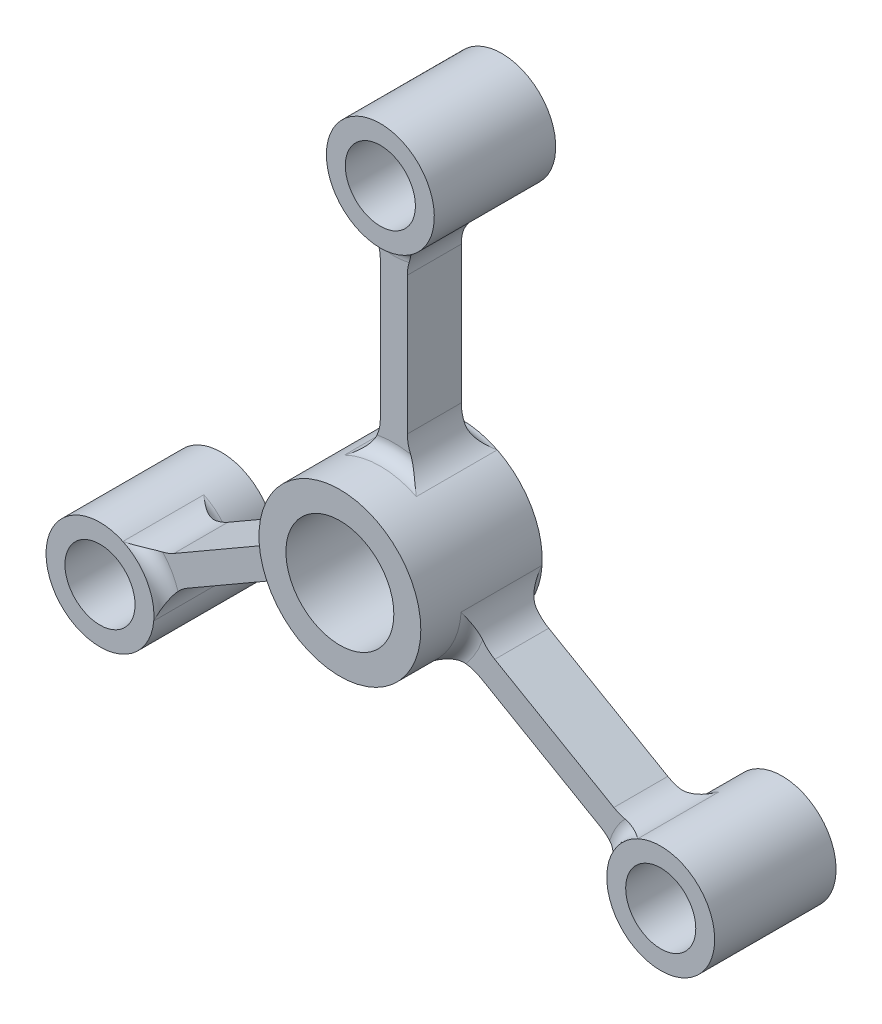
ISO-10303-21;
HEADER;
FILE_DESCRIPTION(('STEP AP214'),'2;1');
FILE_NAME('part.step','',(''),(''),'','','');
FILE_SCHEMA(('AUTOMOTIVE_DESIGN { 1 0 10303 214 1 1 1 1 }'));
ENDSEC;
DATA;
#1=APPLICATION_CONTEXT('core data for automotive mechanical design processes');
#2=APPLICATION_PROTOCOL_DEFINITION('international standard','automotive_design',2000,#1);
#3=PRODUCT_CONTEXT('',#1,'mechanical');
#4=PRODUCT('Part','Part','',(#3));
#5=PRODUCT_RELATED_PRODUCT_CATEGORY('part','',(#4));
#6=PRODUCT_DEFINITION_FORMATION('','',#4);
#7=PRODUCT_DEFINITION_CONTEXT('part definition',#1,'design');
#8=PRODUCT_DEFINITION('design','',#6,#7);
#9=PRODUCT_DEFINITION_SHAPE('','',#8);
#10=(LENGTH_UNIT() NAMED_UNIT(*) SI_UNIT(.MILLI.,.METRE.));
#11=(NAMED_UNIT(*) PLANE_ANGLE_UNIT() SI_UNIT($,.RADIAN.));
#12=(NAMED_UNIT(*) SI_UNIT($,.STERADIAN.) SOLID_ANGLE_UNIT());
#13=UNCERTAINTY_MEASURE_WITH_UNIT(LENGTH_MEASURE(1.E-05),#10,'distance_accuracy_value','');
#14=(GEOMETRIC_REPRESENTATION_CONTEXT(3) GLOBAL_UNCERTAINTY_ASSIGNED_CONTEXT((#13)) GLOBAL_UNIT_ASSIGNED_CONTEXT((#10,
#11,#12)) REPRESENTATION_CONTEXT('',''));
#15=CARTESIAN_POINT('',(0.,0.,0.));
#16=DIRECTION('',(0.,0.,1.));
#17=DIRECTION('',(1.,0.,0.));
#18=AXIS2_PLACEMENT_3D('',#15,#16,#17);
#19=CARTESIAN_POINT('',(0.,0.,0.));
#20=DIRECTION('',(0.,0.,1.));
#21=DIRECTION('',(1.,0.,0.));
#22=AXIS2_PLACEMENT_3D('',#19,#20,#21);
#23=PLANE('',#22);
#24=CARTESIAN_POINT('',(56.5457102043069,-17.9819841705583,0.));
#25=DIRECTION('',(0.,0.,1.));
#26=DIRECTION('',(1.,0.,0.));
#27=AXIS2_PLACEMENT_3D('',#24,#25,#26);
#28=CIRCLE('',#27,9.525);
#29=CARTESIAN_POINT('',(51.7832102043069,-26.2308761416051,0.));
#30=VERTEX_POINT('',#29);
#31=CARTESIAN_POINT('',(54.3928291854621,-27.2604931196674,0.));
#32=VERTEX_POINT('',#31);
#33=EDGE_CURVE('E618',#30,#32,#28,.T.);
#34=ORIENTED_EDGE('',*,*,#33,.T.);
#35=CARTESIAN_POINT('',(65.9911357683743,-38.0999999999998,0.));
#36=DIRECTION('',(0.,0.,1.));
#37=DIRECTION('',(1.,0.,0.));
#38=AXIS2_PLACEMENT_3D('',#35,#36,#37);
#39=CIRCLE('',#38,15.875);
#40=CARTESIAN_POINT('',(50.8046941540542,-33.4753252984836,0.));
#41=VERTEX_POINT('',#40);
#42=EDGE_CURVE('E587',#32,#41,#39,.T.);
#43=ORIENTED_EDGE('',*,*,#42,.T.);
#44=CARTESIAN_POINT('',(43.8457102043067,-39.9790294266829,0.));
#45=DIRECTION('',(0.,0.,1.));
#46=DIRECTION('',(1.,0.,0.));
#47=AXIS2_PLACEMENT_3D('',#44,#45,#46);
#48=CIRCLE('',#47,9.525);
#49=CARTESIAN_POINT('',(48.6082102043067,-31.7301374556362,0.));
#50=VERTEX_POINT('',#49);
#51=EDGE_CURVE('E622',#41,#50,#48,.T.);
#52=ORIENTED_EDGE('',*,*,#51,.T.);
#53=DIRECTION('',(0.86602540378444,-0.499999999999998,0.));
#54=VECTOR('',#53,1.);
#55=CARTESIAN_POINT('',(14.679534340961,-12.1414073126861,0.));
#56=LINE('',#55,#54);
#57=CARTESIAN_POINT('',(20.5807310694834,-15.5484648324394,0.));
#58=VERTEX_POINT('',#57);
#59=EDGE_CURVE('E659',#58,#50,#56,.T.);
#60=ORIENTED_EDGE('',*,*,#59,.F.);
#61=CARTESIAN_POINT('',(15.8182310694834,-23.7973568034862,0.));
#62=DIRECTION('',(0.,0.,1.));
#63=DIRECTION('',(1.,0.,0.));
#64=AXIS2_PLACEMENT_3D('',#61,#62,#63);
#65=CIRCLE('',#64,9.525);
#66=CARTESIAN_POINT('',(16.9771985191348,-14.3431292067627,0.));
#67=VERTEX_POINT('',#66);
#68=EDGE_CURVE('E716',#58,#67,#65,.T.);
#69=ORIENTED_EDGE('',*,*,#68,.T.);
#70=CARTESIAN_POINT('',(0.,0.,0.));
#71=DIRECTION('',(0.,0.,1.));
#72=DIRECTION('',(1.,0.,0.));
#73=AXIS2_PLACEMENT_3D('',#70,#71,#72);
#74=CIRCLE('',#73,22.225);
#75=CARTESIAN_POINT('',(20.9101135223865,-7.53112059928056,0.));
#76=VERTEX_POINT('',#75);
#77=EDGE_CURVE('E740',#67,#76,#74,.T.);
#78=ORIENTED_EDGE('',*,*,#77,.T.);
#79=CARTESIAN_POINT('',(28.5182310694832,-1.80031154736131,0.));
#80=DIRECTION('',(0.,0.,1.));
#81=DIRECTION('',(1.,0.,0.));
#82=AXIS2_PLACEMENT_3D('',#79,#80,#81);
#83=CIRCLE('',#82,9.525);
#84=CARTESIAN_POINT('',(23.7557310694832,-10.0492035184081,0.));
#85=VERTEX_POINT('',#84);
#86=EDGE_CURVE('E683',#76,#85,#83,.T.);
#87=ORIENTED_EDGE('',*,*,#86,.T.);
#88=DIRECTION('',(0.86602540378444,-0.499999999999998,0.));
#89=VECTOR('',#88,1.);
#90=CARTESIAN_POINT('',(17.854534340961,-6.64214599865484,0.));
#91=LINE('',#90,#89);
#92=EDGE_CURVE('E293',#85,#30,#91,.T.);
#93=ORIENTED_EDGE('',*,*,#92,.T.);
#94=EDGE_LOOP('',(#34,#43,#52,#60,#69,#78,#87,#93));
#95=FACE_BOUND('',#94,.T.);
#96=ADVANCED_FACE('F43',(#95),#23,.F.);
#97=CARTESIAN_POINT('',(-43.8457102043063,-39.9790294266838,0.));
#98=DIRECTION('',(0.,0.,1.));
#99=DIRECTION('',(1.,0.,0.));
#100=AXIS2_PLACEMENT_3D('',#97,#98,#99);
#101=CIRCLE('',#100,9.525);
#102=CARTESIAN_POINT('',(-48.6082102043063,-31.730137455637,0.));
#103=VERTEX_POINT('',#102);
#104=CARTESIAN_POINT('',(-50.8046941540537,-33.4753252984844,0.));
#105=VERTEX_POINT('',#104);
#106=EDGE_CURVE('E559',#103,#105,#101,.T.);
#107=ORIENTED_EDGE('',*,*,#106,.T.);
#108=CARTESIAN_POINT('',(-65.9911357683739,-38.1000000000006,0.));
#109=DIRECTION('',(0.,0.,1.));
#110=DIRECTION('',(1.,0.,0.));
#111=AXIS2_PLACEMENT_3D('',#108,#109,#110);
#112=CIRCLE('',#111,15.875);
#113=CARTESIAN_POINT('',(-54.3928291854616,-27.2604931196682,0.));
#114=VERTEX_POINT('',#113);
#115=EDGE_CURVE('E569',#105,#114,#112,.T.);
#116=ORIENTED_EDGE('',*,*,#115,.T.);
#117=CARTESIAN_POINT('',(-56.5457102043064,-17.9819841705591,0.));
#118=DIRECTION('',(0.,0.,1.));
#119=DIRECTION('',(1.,0.,0.));
#120=AXIS2_PLACEMENT_3D('',#117,#118,#119);
#121=CIRCLE('',#120,9.525);
#122=CARTESIAN_POINT('',(-51.7832102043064,-26.2308761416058,0.));
#123=VERTEX_POINT('',#122);
#124=EDGE_CURVE('E560',#114,#123,#121,.T.);
#125=ORIENTED_EDGE('',*,*,#124,.T.);
#126=DIRECTION('',(0.866025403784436,0.500000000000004,0.));
#127=VECTOR('',#126,1.);
#128=CARTESIAN_POINT('',(-56.9293620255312,-29.2020082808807,0.));
#129=LINE('',#128,#127);
#130=CARTESIAN_POINT('',(-23.7557310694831,-10.0492035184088,0.));
#131=VERTEX_POINT('',#130);
#132=EDGE_CURVE('E375',#123,#131,#129,.T.);
#133=ORIENTED_EDGE('',*,*,#132,.T.);
#134=CARTESIAN_POINT('',(-28.5182310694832,-1.80031154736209,0.));
#135=DIRECTION('',(0.,0.,1.));
#136=DIRECTION('',(1.,0.,0.));
#137=AXIS2_PLACEMENT_3D('',#134,#135,#136);
#138=CIRCLE('',#137,9.525);
#139=CARTESIAN_POINT('',(-20.9101135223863,-7.53112059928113,0.));
#140=VERTEX_POINT('',#139);
#141=EDGE_CURVE('E706',#131,#140,#138,.T.);
#142=ORIENTED_EDGE('',*,*,#141,.T.);
#143=CARTESIAN_POINT('',(0.,0.,0.));
#144=DIRECTION('',(0.,0.,1.));
#145=DIRECTION('',(1.,0.,0.));
#146=AXIS2_PLACEMENT_3D('',#143,#144,#145);
#147=CIRCLE('',#146,22.225);
#148=CARTESIAN_POINT('',(-16.9771985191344,-14.3431292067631,0.));
#149=VERTEX_POINT('',#148);
#150=EDGE_CURVE('E736',#140,#149,#147,.T.);
#151=ORIENTED_EDGE('',*,*,#150,.T.);
#152=CARTESIAN_POINT('',(-15.8182310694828,-23.7973568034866,0.));
#153=DIRECTION('',(0.,0.,1.));
#154=DIRECTION('',(1.,0.,0.));
#155=AXIS2_PLACEMENT_3D('',#152,#153,#154);
#156=CIRCLE('',#155,9.525);
#157=CARTESIAN_POINT('',(-20.5807310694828,-15.5484648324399,0.));
#158=VERTEX_POINT('',#157);
#159=EDGE_CURVE('E711',#149,#158,#156,.T.);
#160=ORIENTED_EDGE('',*,*,#159,.T.);
#161=DIRECTION('',(0.866025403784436,0.500000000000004,0.));
#162=VECTOR('',#161,1.);
#163=CARTESIAN_POINT('',(-53.7543620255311,-34.7012695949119,0.));
#164=LINE('',#163,#162);
#165=EDGE_CURVE('E358',#103,#158,#164,.T.);
#166=ORIENTED_EDGE('',*,*,#165,.F.);
#167=EDGE_LOOP('',(#107,#116,#125,#133,#142,#151,#160,#166));
#168=FACE_BOUND('',#167,.T.);
#169=ADVANCED_FACE('F521',(#168),#23,.F.);
#170=CARTESIAN_POINT('',(-12.7,57.9610135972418,0.));
#171=DIRECTION('',(0.,0.,1.));
#172=DIRECTION('',(1.,0.,0.));
#173=AXIS2_PLACEMENT_3D('',#170,#171,#172);
#174=CIRCLE('',#173,9.525);
#175=CARTESIAN_POINT('',(-3.17500000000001,57.9610135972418,0.));
#176=VERTEX_POINT('',#175);
#177=CARTESIAN_POINT('',(-3.58813503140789,60.7358184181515,0.));
#178=VERTEX_POINT('',#177);
#179=EDGE_CURVE('E611',#176,#178,#174,.T.);
#180=ORIENTED_EDGE('',*,*,#179,.T.);
#181=CARTESIAN_POINT('',(0.,76.2,0.));
#182=DIRECTION('',(0.,0.,1.));
#183=DIRECTION('',(1.,0.,0.));
#184=AXIS2_PLACEMENT_3D('',#181,#182,#183);
#185=CIRCLE('',#184,15.875);
#186=CARTESIAN_POINT('',(3.58813503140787,60.7358184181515,0.));
#187=VERTEX_POINT('',#186);
#188=EDGE_CURVE('E582',#178,#187,#185,.T.);
#189=ORIENTED_EDGE('',*,*,#188,.T.);
#190=CARTESIAN_POINT('',(12.7,57.9610135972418,0.));
#191=DIRECTION('',(0.,0.,1.));
#192=DIRECTION('',(1.,0.,0.));
#193=AXIS2_PLACEMENT_3D('',#190,#191,#192);
#194=CIRCLE('',#193,9.525);
#195=CARTESIAN_POINT('',(3.175,57.9610135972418,0.));
#196=VERTEX_POINT('',#195);
#197=EDGE_CURVE('E288',#187,#196,#194,.T.);
#198=ORIENTED_EDGE('',*,*,#197,.T.);
#199=DIRECTION('',(0.,-1.,0.));
#200=VECTOR('',#199,1.);
#201=CARTESIAN_POINT('',(3.175,63.9032778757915,0.));
#202=LINE('',#201,#200);
#203=CARTESIAN_POINT('',(3.17499999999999,25.5976683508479,0.));
#204=VERTEX_POINT('',#203);
#205=EDGE_CURVE('E281',#196,#204,#202,.T.);
#206=ORIENTED_EDGE('',*,*,#205,.T.);
#207=CARTESIAN_POINT('',(12.7,25.5976683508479,0.));
#208=DIRECTION('',(0.,0.,1.));
#209=DIRECTION('',(1.,0.,0.));
#210=AXIS2_PLACEMENT_3D('',#207,#208,#209);
#211=CIRCLE('',#210,9.525);
#212=CARTESIAN_POINT('',(3.9329150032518,21.8742498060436,0.));
#213=VERTEX_POINT('',#212);
#214=EDGE_CURVE('E285',#204,#213,#211,.T.);
#215=ORIENTED_EDGE('',*,*,#214,.T.);
#216=CARTESIAN_POINT('',(0.,0.,0.));
#217=DIRECTION('',(0.,0.,1.));
#218=DIRECTION('',(1.,0.,0.));
#219=AXIS2_PLACEMENT_3D('',#216,#217,#218);
#220=CIRCLE('',#219,22.225);
#221=CARTESIAN_POINT('',(-3.93291500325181,21.8742498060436,0.));
#222=VERTEX_POINT('',#221);
#223=EDGE_CURVE('E738',#213,#222,#220,.T.);
#224=ORIENTED_EDGE('',*,*,#223,.T.);
#225=CARTESIAN_POINT('',(-12.7,25.5976683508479,0.));
#226=DIRECTION('',(0.,0.,1.));
#227=DIRECTION('',(1.,0.,0.));
#228=AXIS2_PLACEMENT_3D('',#225,#226,#227);
#229=CIRCLE('',#228,9.525);
#230=CARTESIAN_POINT('',(-3.17499999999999,25.5976683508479,0.));
#231=VERTEX_POINT('',#230);
#232=EDGE_CURVE('E700',#222,#231,#229,.T.);
#233=ORIENTED_EDGE('',*,*,#232,.T.);
#234=DIRECTION('',(0.,-1.,0.));
#235=VECTOR('',#234,1.);
#236=CARTESIAN_POINT('',(-3.17500000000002,63.9032778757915,0.));
#237=LINE('',#236,#235);
#238=EDGE_CURVE('E292',#176,#231,#237,.T.);
#239=ORIENTED_EDGE('',*,*,#238,.F.);
#240=EDGE_LOOP('',(#180,#189,#198,#206,#215,#224,#233,#239));
#241=FACE_BOUND('',#240,.T.);
#242=ADVANCED_FACE('F284',(#241),#23,.F.);
#243=CARTESIAN_POINT('',(0.,0.,12.7));
#244=DIRECTION('',(0.,0.,1.));
#245=DIRECTION('',(1.,0.,0.));
#246=AXIS2_PLACEMENT_3D('',#243,#244,#245);
#247=PLANE('',#246);
#248=CARTESIAN_POINT('',(12.7,57.9610135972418,12.7));
#249=DIRECTION('',(0.,0.,1.));
#250=DIRECTION('',(1.,0.,0.));
#251=AXIS2_PLACEMENT_3D('',#248,#249,#250);
#252=CIRCLE('',#251,9.525);
#253=CARTESIAN_POINT('',(3.175,57.9610135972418,12.7));
#254=VERTEX_POINT('',#253);
#255=CARTESIAN_POINT('',(3.58813503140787,60.7358184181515,12.7));
#256=VERTEX_POINT('',#255);
#257=EDGE_CURVE('E616',#254,#256,#252,.F.);
#258=ORIENTED_EDGE('',*,*,#257,.T.);
#259=CARTESIAN_POINT('',(0.,76.2,12.7));
#260=DIRECTION('',(0.,0.,1.));
#261=DIRECTION('',(1.,0.,0.));
#262=AXIS2_PLACEMENT_3D('',#259,#260,#261);
#263=CIRCLE('',#262,15.875);
#264=CARTESIAN_POINT('',(-3.58813503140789,60.7358184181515,12.7));
#265=VERTEX_POINT('',#264);
#266=EDGE_CURVE('E580',#256,#265,#263,.F.);
#267=ORIENTED_EDGE('',*,*,#266,.T.);
#268=CARTESIAN_POINT('',(-12.7,57.9610135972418,12.7));
#269=DIRECTION('',(0.,0.,1.));
#270=DIRECTION('',(1.,0.,0.));
#271=AXIS2_PLACEMENT_3D('',#268,#269,#270);
#272=CIRCLE('',#271,9.525);
#273=CARTESIAN_POINT('',(-3.17500000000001,57.9610135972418,12.7));
#274=VERTEX_POINT('',#273);
#275=EDGE_CURVE('E613',#265,#274,#272,.F.);
#276=ORIENTED_EDGE('',*,*,#275,.T.);
#277=DIRECTION('',(0.,-1.,0.));
#278=VECTOR('',#277,1.);
#279=CARTESIAN_POINT('',(-3.17500000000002,63.9032778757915,12.7));
#280=LINE('',#279,#278);
#281=CARTESIAN_POINT('',(-3.17499999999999,25.5976683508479,12.7));
#282=VERTEX_POINT('',#281);
#283=EDGE_CURVE('E310',#274,#282,#280,.T.);
#284=ORIENTED_EDGE('',*,*,#283,.T.);
#285=CARTESIAN_POINT('',(-12.7,25.5976683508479,12.7));
#286=DIRECTION('',(0.,0.,1.));
#287=DIRECTION('',(1.,0.,0.));
#288=AXIS2_PLACEMENT_3D('',#285,#286,#287);
#289=CIRCLE('',#288,9.525);
#290=CARTESIAN_POINT('',(-3.93291500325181,21.8742498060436,12.7));
#291=VERTEX_POINT('',#290);
#292=EDGE_CURVE('E703',#282,#291,#289,.F.);
#293=ORIENTED_EDGE('',*,*,#292,.T.);
#294=CARTESIAN_POINT('',(0.,0.,12.7));
#295=DIRECTION('',(0.,0.,1.));
#296=DIRECTION('',(1.,0.,0.));
#297=AXIS2_PLACEMENT_3D('',#294,#295,#296);
#298=CIRCLE('',#297,22.225);
#299=CARTESIAN_POINT('',(3.9329150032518,21.8742498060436,12.7));
#300=VERTEX_POINT('',#299);
#301=EDGE_CURVE('E734',#291,#300,#298,.F.);
#302=ORIENTED_EDGE('',*,*,#301,.T.);
#303=CARTESIAN_POINT('',(12.7,25.5976683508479,12.7));
#304=DIRECTION('',(0.,0.,1.));
#305=DIRECTION('',(1.,0.,0.));
#306=AXIS2_PLACEMENT_3D('',#303,#304,#305);
#307=CIRCLE('',#306,9.525);
#308=CARTESIAN_POINT('',(3.17499999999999,25.5976683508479,12.7));
#309=VERTEX_POINT('',#308);
#310=EDGE_CURVE('E302',#300,#309,#307,.F.);
#311=ORIENTED_EDGE('',*,*,#310,.T.);
#312=DIRECTION('',(0.,-1.,0.));
#313=VECTOR('',#312,1.);
#314=CARTESIAN_POINT('',(3.175,63.9032778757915,12.7));
#315=LINE('',#314,#313);
#316=EDGE_CURVE('E307',#254,#309,#315,.T.);
#317=ORIENTED_EDGE('',*,*,#316,.F.);
#318=EDGE_LOOP('',(#258,#267,#276,#284,#293,#302,#311,#317));
#319=FACE_BOUND('',#318,.T.);
#320=ADVANCED_FACE('F532',(#319),#247,.T.);
#321=CARTESIAN_POINT('',(43.8457102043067,-39.9790294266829,12.7));
#322=DIRECTION('',(0.,0.,1.));
#323=DIRECTION('',(1.,0.,0.));
#324=AXIS2_PLACEMENT_3D('',#321,#322,#323);
#325=CIRCLE('',#324,9.525);
#326=CARTESIAN_POINT('',(48.6082102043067,-31.7301374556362,12.7));
#327=VERTEX_POINT('',#326);
#328=CARTESIAN_POINT('',(50.8046941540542,-33.4753252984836,12.7));
#329=VERTEX_POINT('',#328);
#330=EDGE_CURVE('E574',#327,#329,#325,.F.);
#331=ORIENTED_EDGE('',*,*,#330,.T.);
#332=CARTESIAN_POINT('',(65.9911357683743,-38.0999999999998,12.7));
#333=DIRECTION('',(0.,0.,1.));
#334=DIRECTION('',(1.,0.,0.));
#335=AXIS2_PLACEMENT_3D('',#332,#333,#334);
#336=CIRCLE('',#335,15.875);
#337=CARTESIAN_POINT('',(54.3928291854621,-27.2604931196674,12.7));
#338=VERTEX_POINT('',#337);
#339=EDGE_CURVE('E63',#329,#338,#336,.F.);
#340=ORIENTED_EDGE('',*,*,#339,.T.);
#341=CARTESIAN_POINT('',(56.5457102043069,-17.9819841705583,12.7));
#342=DIRECTION('',(0.,0.,1.));
#343=DIRECTION('',(1.,0.,0.));
#344=AXIS2_PLACEMENT_3D('',#341,#342,#343);
#345=CIRCLE('',#344,9.525);
#346=CARTESIAN_POINT('',(51.7832102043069,-26.2308761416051,12.7));
#347=VERTEX_POINT('',#346);
#348=EDGE_CURVE('E620',#338,#347,#345,.F.);
#349=ORIENTED_EDGE('',*,*,#348,.T.);
#350=DIRECTION('',(0.86602540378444,-0.499999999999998,0.));
#351=VECTOR('',#350,1.);
#352=CARTESIAN_POINT('',(17.854534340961,-6.64214599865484,12.7));
#353=LINE('',#352,#351);
#354=CARTESIAN_POINT('',(23.7557310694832,-10.0492035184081,12.7));
#355=VERTEX_POINT('',#354);
#356=EDGE_CURVE('E342',#355,#347,#353,.T.);
#357=ORIENTED_EDGE('',*,*,#356,.F.);
#358=CARTESIAN_POINT('',(28.5182310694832,-1.80031154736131,12.7));
#359=DIRECTION('',(0.,0.,1.));
#360=DIRECTION('',(1.,0.,0.));
#361=AXIS2_PLACEMENT_3D('',#358,#359,#360);
#362=CIRCLE('',#361,9.525);
#363=CARTESIAN_POINT('',(20.9101135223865,-7.53112059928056,12.7));
#364=VERTEX_POINT('',#363);
#365=EDGE_CURVE('E695',#355,#364,#362,.F.);
#366=ORIENTED_EDGE('',*,*,#365,.T.);
#367=CARTESIAN_POINT('',(0.,0.,12.7));
#368=DIRECTION('',(0.,0.,1.));
#369=DIRECTION('',(1.,0.,0.));
#370=AXIS2_PLACEMENT_3D('',#367,#368,#369);
#371=CIRCLE('',#370,22.225);
#372=CARTESIAN_POINT('',(16.9771985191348,-14.3431292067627,12.7));
#373=VERTEX_POINT('',#372);
#374=EDGE_CURVE('E742',#364,#373,#371,.F.);
#375=ORIENTED_EDGE('',*,*,#374,.T.);
#376=CARTESIAN_POINT('',(15.8182310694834,-23.7973568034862,12.7));
#377=DIRECTION('',(0.,0.,1.));
#378=DIRECTION('',(1.,0.,0.));
#379=AXIS2_PLACEMENT_3D('',#376,#377,#378);
#380=CIRCLE('',#379,9.525);
#381=CARTESIAN_POINT('',(20.5807310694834,-15.5484648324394,12.7));
#382=VERTEX_POINT('',#381);
#383=EDGE_CURVE('E719',#373,#382,#380,.F.);
#384=ORIENTED_EDGE('',*,*,#383,.T.);
#385=DIRECTION('',(0.86602540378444,-0.499999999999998,0.));
#386=VECTOR('',#385,1.);
#387=CARTESIAN_POINT('',(14.679534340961,-12.1414073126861,12.7));
#388=LINE('',#387,#386);
#389=EDGE_CURVE('E338',#382,#327,#388,.T.);
#390=ORIENTED_EDGE('',*,*,#389,.T.);
#391=EDGE_LOOP('',(#331,#340,#349,#357,#366,#375,#384,#390));
#392=FACE_BOUND('',#391,.T.);
#393=ADVANCED_FACE('F536',(#392),#247,.T.);
#394=CARTESIAN_POINT('',(-56.5457102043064,-17.9819841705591,12.7));
#395=DIRECTION('',(0.,0.,1.));
#396=DIRECTION('',(1.,0.,0.));
#397=AXIS2_PLACEMENT_3D('',#394,#395,#396);
#398=CIRCLE('',#397,9.525);
#399=CARTESIAN_POINT('',(-51.7832102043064,-26.2308761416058,12.7));
#400=VERTEX_POINT('',#399);
#401=CARTESIAN_POINT('',(-54.3928291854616,-27.2604931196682,12.7));
#402=VERTEX_POINT('',#401);
#403=EDGE_CURVE('E554',#400,#402,#398,.F.);
#404=ORIENTED_EDGE('',*,*,#403,.T.);
#405=CARTESIAN_POINT('',(-65.9911357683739,-38.1000000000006,12.7));
#406=DIRECTION('',(0.,0.,1.));
#407=DIRECTION('',(1.,0.,0.));
#408=AXIS2_PLACEMENT_3D('',#405,#406,#407);
#409=CIRCLE('',#408,15.875);
#410=CARTESIAN_POINT('',(-50.8046941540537,-33.4753252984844,12.7));
#411=VERTEX_POINT('',#410);
#412=EDGE_CURVE('E556',#402,#411,#409,.F.);
#413=ORIENTED_EDGE('',*,*,#412,.T.);
#414=CARTESIAN_POINT('',(-43.8457102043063,-39.9790294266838,12.7));
#415=DIRECTION('',(0.,0.,1.));
#416=DIRECTION('',(1.,0.,0.));
#417=AXIS2_PLACEMENT_3D('',#414,#415,#416);
#418=CIRCLE('',#417,9.525);
#419=CARTESIAN_POINT('',(-48.6082102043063,-31.730137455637,12.7));
#420=VERTEX_POINT('',#419);
#421=EDGE_CURVE('E601',#411,#420,#418,.F.);
#422=ORIENTED_EDGE('',*,*,#421,.T.);
#423=DIRECTION('',(0.866025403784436,0.500000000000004,0.));
#424=VECTOR('',#423,1.);
#425=CARTESIAN_POINT('',(-53.7543620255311,-34.7012695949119,12.7));
#426=LINE('',#425,#424);
#427=CARTESIAN_POINT('',(-20.5807310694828,-15.5484648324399,12.7));
#428=VERTEX_POINT('',#427);
#429=EDGE_CURVE('E343',#420,#428,#426,.T.);
#430=ORIENTED_EDGE('',*,*,#429,.T.);
#431=CARTESIAN_POINT('',(-15.8182310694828,-23.7973568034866,12.7));
#432=DIRECTION('',(0.,0.,1.));
#433=DIRECTION('',(1.,0.,0.));
#434=AXIS2_PLACEMENT_3D('',#431,#432,#433);
#435=CIRCLE('',#434,9.525);
#436=CARTESIAN_POINT('',(-16.9771985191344,-14.3431292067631,12.7));
#437=VERTEX_POINT('',#436);
#438=EDGE_CURVE('E713',#428,#437,#435,.F.);
#439=ORIENTED_EDGE('',*,*,#438,.T.);
#440=CARTESIAN_POINT('',(0.,0.,12.7));
#441=DIRECTION('',(0.,0.,1.));
#442=DIRECTION('',(1.,0.,0.));
#443=AXIS2_PLACEMENT_3D('',#440,#441,#442);
#444=CIRCLE('',#443,22.225);
#445=CARTESIAN_POINT('',(-20.9101135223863,-7.53112059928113,12.7));
#446=VERTEX_POINT('',#445);
#447=EDGE_CURVE('E732',#437,#446,#444,.F.);
#448=ORIENTED_EDGE('',*,*,#447,.T.);
#449=CARTESIAN_POINT('',(-28.5182310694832,-1.80031154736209,12.7));
#450=DIRECTION('',(0.,0.,1.));
#451=DIRECTION('',(1.,0.,0.));
#452=AXIS2_PLACEMENT_3D('',#449,#450,#451);
#453=CIRCLE('',#452,9.525);
#454=CARTESIAN_POINT('',(-23.7557310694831,-10.0492035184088,12.7));
#455=VERTEX_POINT('',#454);
#456=EDGE_CURVE('E709',#446,#455,#453,.F.);
#457=ORIENTED_EDGE('',*,*,#456,.T.);
#458=DIRECTION('',(0.866025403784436,0.500000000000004,0.));
#459=VECTOR('',#458,1.);
#460=CARTESIAN_POINT('',(-56.9293620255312,-29.2020082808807,12.7));
#461=LINE('',#460,#459);
#462=EDGE_CURVE('E357',#400,#455,#461,.T.);
#463=ORIENTED_EDGE('',*,*,#462,.F.);
#464=EDGE_LOOP('',(#404,#413,#422,#430,#439,#448,#457,#463));
#465=FACE_BOUND('',#464,.T.);
#466=ADVANCED_FACE('F538',(#465),#247,.T.);
#467=CARTESIAN_POINT('',(-56.9293620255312,-29.2020082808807,12.7));
#468=DIRECTION('',(-0.500000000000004,0.866025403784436,0.));
#469=DIRECTION('',(-0.866025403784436,-0.500000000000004,0.));
#470=AXIS2_PLACEMENT_3D('',#467,#468,#469);
#471=PLANE('',#470);
#472=ORIENTED_EDGE('',*,*,#132,.F.);
#473=DIRECTION('',(0.,0.,-1.));
#474=VECTOR('',#473,1.);
#475=CARTESIAN_POINT('',(-51.7832102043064,-26.2308761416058,12.7));
#476=LINE('',#475,#474);
#477=EDGE_CURVE('E364',#123,#400,#476,.F.);
#478=ORIENTED_EDGE('',*,*,#477,.T.);
#479=ORIENTED_EDGE('',*,*,#462,.T.);
#480=DIRECTION('',(0.,0.,-1.));
#481=VECTOR('',#480,1.);
#482=CARTESIAN_POINT('',(-23.7557310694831,-10.0492035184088,12.7));
#483=LINE('',#482,#481);
#484=EDGE_CURVE('E331',#455,#131,#483,.T.);
#485=ORIENTED_EDGE('',*,*,#484,.T.);
#486=EDGE_LOOP('',(#472,#478,#479,#485));
#487=FACE_BOUND('',#486,.T.);
#488=ADVANCED_FACE('F545',(#487),#471,.T.);
#489=CARTESIAN_POINT('',(-65.9911357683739,-38.1000000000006,12.7));
#490=DIRECTION('',(0.,0.,-1.));
#491=DIRECTION('',(-1.,0.,0.));
#492=AXIS2_PLACEMENT_3D('',#489,#490,#491);
#493=CYLINDRICAL_SURFACE('',#492,12.7);
#494=CARTESIAN_POINT('',(-65.9911357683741,-38.1000000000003,15.875));
#495=DIRECTION('',(0.,0.,1.));
#496=DIRECTION('',(1.,0.,0.));
#497=AXIS2_PLACEMENT_3D('',#494,#495,#496);
#498=CIRCLE('',#497,12.7);
#499=CARTESIAN_POINT('',(-60.5937497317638,-26.6039909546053,15.875));
#500=VERTEX_POINT('',#499);
#501=CARTESIAN_POINT('',(-53.3366068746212,-39.1737311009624,15.875));
#502=VERTEX_POINT('',#501);
#503=EDGE_CURVE('E646',#500,#502,#498,.T.);
#504=ORIENTED_EDGE('',*,*,#503,.F.);
#505=DIRECTION('',(0.,0.,-1.));
#506=VECTOR('',#505,1.);
#507=CARTESIAN_POINT('',(-60.5937497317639,-26.6039909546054,12.7));
#508=LINE('',#507,#506);
#509=CARTESIAN_POINT('',(-60.5937497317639,-26.6039909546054,-3.175));
#510=VERTEX_POINT('',#509);
#511=EDGE_CURVE('E379',#500,#510,#508,.T.);
#512=ORIENTED_EDGE('',*,*,#511,.T.);
#513=CARTESIAN_POINT('',(-65.9911357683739,-38.1000000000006,-3.175));
#514=DIRECTION('',(0.,0.,1.));
#515=DIRECTION('',(1.,0.,0.));
#516=AXIS2_PLACEMENT_3D('',#513,#514,#515);
#517=CIRCLE('',#516,12.7);
#518=CARTESIAN_POINT('',(-53.336606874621,-39.1737311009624,-3.175));
#519=VERTEX_POINT('',#518);
#520=EDGE_CURVE('E570',#510,#519,#517,.F.);
#521=ORIENTED_EDGE('',*,*,#520,.T.);
#522=DIRECTION('',(0.,0.,-1.));
#523=VECTOR('',#522,1.);
#524=CARTESIAN_POINT('',(-53.336606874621,-39.1737311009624,12.7));
#525=LINE('',#524,#523);
#526=EDGE_CURVE('E384',#519,#502,#525,.F.);
#527=ORIENTED_EDGE('',*,*,#526,.T.);
#528=EDGE_LOOP('',(#504,#512,#521,#527));
#529=FACE_BOUND('',#528,.T.);
#530=CARTESIAN_POINT('',(-65.9911357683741,-38.1000000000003,-12.7));
#531=DIRECTION('',(0.,0.,-1.));
#532=DIRECTION('',(-1.,0.,0.));
#533=AXIS2_PLACEMENT_3D('',#530,#531,#532);
#534=CIRCLE('',#533,12.7);
#535=CARTESIAN_POINT('',(-78.6911357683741,-38.1000000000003,-12.7));
#536=VERTEX_POINT('',#535);
#537=EDGE_CURVE('E654',#536,#536,#534,.T.);
#538=ORIENTED_EDGE('',*,*,#537,.F.);
#539=EDGE_LOOP('',(#538));
#540=FACE_BOUND('',#539,.T.);
#541=ADVANCED_FACE('F550',(#529,#540),#493,.T.);
#542=CARTESIAN_POINT('',(-53.7543620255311,-34.7012695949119,12.7));
#543=DIRECTION('',(-0.500000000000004,0.866025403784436,0.));
#544=DIRECTION('',(-0.866025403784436,-0.500000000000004,0.));
#545=AXIS2_PLACEMENT_3D('',#542,#543,#544);
#546=PLANE('',#545);
#547=ORIENTED_EDGE('',*,*,#429,.F.);
#548=DIRECTION('',(0.,0.,1.));
#549=VECTOR('',#548,1.);
#550=CARTESIAN_POINT('',(-48.6082102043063,-31.730137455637,0.));
#551=LINE('',#550,#549);
#552=EDGE_CURVE('E361',#420,#103,#551,.F.);
#553=ORIENTED_EDGE('',*,*,#552,.T.);
#554=ORIENTED_EDGE('',*,*,#165,.T.);
#555=DIRECTION('',(0.,0.,1.));
#556=VECTOR('',#555,1.);
#557=CARTESIAN_POINT('',(-20.5807310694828,-15.5484648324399,12.7));
#558=LINE('',#557,#556);
#559=EDGE_CURVE('E334',#158,#428,#558,.T.);
#560=ORIENTED_EDGE('',*,*,#559,.T.);
#561=EDGE_LOOP('',(#547,#553,#554,#560));
#562=FACE_BOUND('',#561,.T.);
#563=ADVANCED_FACE('F937',(#562),#546,.F.);
#564=CARTESIAN_POINT('',(14.679534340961,-12.1414073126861,12.7));
#565=DIRECTION('',(0.499999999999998,0.86602540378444,0.));
#566=DIRECTION('',(-0.86602540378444,0.499999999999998,0.));
#567=AXIS2_PLACEMENT_3D('',#564,#565,#566);
#568=PLANE('',#567);
#569=ORIENTED_EDGE('',*,*,#59,.T.);
#570=DIRECTION('',(0.,0.,1.));
#571=VECTOR('',#570,1.);
#572=CARTESIAN_POINT('',(48.6082102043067,-31.7301374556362,12.7));
#573=LINE('',#572,#571);
#574=EDGE_CURVE('E604',#50,#327,#573,.T.);
#575=ORIENTED_EDGE('',*,*,#574,.T.);
#576=ORIENTED_EDGE('',*,*,#389,.F.);
#577=DIRECTION('',(0.,0.,1.));
#578=VECTOR('',#577,1.);
#579=CARTESIAN_POINT('',(20.5807310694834,-15.5484648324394,0.));
#580=LINE('',#579,#578);
#581=EDGE_CURVE('E337',#382,#58,#580,.F.);
#582=ORIENTED_EDGE('',*,*,#581,.T.);
#583=EDGE_LOOP('',(#569,#575,#576,#582));
#584=FACE_BOUND('',#583,.T.);
#585=ADVANCED_FACE('F934',(#584),#568,.F.);
#586=CARTESIAN_POINT('',(65.9911357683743,-38.0999999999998,12.7));
#587=DIRECTION('',(0.,0.,-1.));
#588=DIRECTION('',(-1.,0.,0.));
#589=AXIS2_PLACEMENT_3D('',#586,#587,#588);
#590=CYLINDRICAL_SURFACE('',#589,12.7);
#591=CARTESIAN_POINT('',(65.9911357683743,-38.0999999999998,-3.175));
#592=DIRECTION('',(0.,0.,1.));
#593=DIRECTION('',(1.,0.,0.));
#594=AXIS2_PLACEMENT_3D('',#591,#592,#593);
#595=CIRCLE('',#594,12.7);
#596=CARTESIAN_POINT('',(53.3366068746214,-39.1737311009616,-3.175));
#597=VERTEX_POINT('',#596);
#598=CARTESIAN_POINT('',(60.5937497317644,-26.6039909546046,-3.175));
#599=VERTEX_POINT('',#598);
#600=EDGE_CURVE('E584',#597,#599,#595,.F.);
#601=ORIENTED_EDGE('',*,*,#600,.T.);
#602=DIRECTION('',(0.,0.,-1.));
#603=VECTOR('',#602,1.);
#604=CARTESIAN_POINT('',(60.5937497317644,-26.6039909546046,12.7));
#605=LINE('',#604,#603);
#606=CARTESIAN_POINT('',(60.5937497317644,-26.6039909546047,15.875));
#607=VERTEX_POINT('',#606);
#608=EDGE_CURVE('E606',#599,#607,#605,.F.);
#609=ORIENTED_EDGE('',*,*,#608,.T.);
#610=CARTESIAN_POINT('',(65.9911357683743,-38.0999999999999,15.875));
#611=DIRECTION('',(0.,0.,1.));
#612=DIRECTION('',(1.,0.,0.));
#613=AXIS2_PLACEMENT_3D('',#610,#611,#612);
#614=CIRCLE('',#613,12.7);
#615=CARTESIAN_POINT('',(53.3366068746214,-39.1737311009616,15.875));
#616=VERTEX_POINT('',#615);
#617=EDGE_CURVE('E635',#616,#607,#614,.T.);
#618=ORIENTED_EDGE('',*,*,#617,.F.);
#619=DIRECTION('',(0.,0.,-1.));
#620=VECTOR('',#619,1.);
#621=CARTESIAN_POINT('',(53.3366068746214,-39.1737311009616,12.7));
#622=LINE('',#621,#620);
#623=EDGE_CURVE('E674',#616,#597,#622,.T.);
#624=ORIENTED_EDGE('',*,*,#623,.T.);
#625=EDGE_LOOP('',(#601,#609,#618,#624));
#626=FACE_BOUND('',#625,.T.);
#627=CARTESIAN_POINT('',(65.9911357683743,-38.0999999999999,-12.7));
#628=DIRECTION('',(0.,0.,-1.));
#629=DIRECTION('',(-1.,0.,0.));
#630=AXIS2_PLACEMENT_3D('',#627,#628,#629);
#631=CIRCLE('',#630,12.7);
#632=CARTESIAN_POINT('',(53.2911357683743,-38.0999999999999,-12.7));
#633=VERTEX_POINT('',#632);
#634=EDGE_CURVE('E651',#633,#633,#631,.T.);
#635=ORIENTED_EDGE('',*,*,#634,.F.);
#636=EDGE_LOOP('',(#635));
#637=FACE_BOUND('',#636,.T.);
#638=ADVANCED_FACE('F675',(#626,#637),#590,.T.);
#639=CARTESIAN_POINT('',(17.854534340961,-6.64214599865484,12.7));
#640=DIRECTION('',(0.499999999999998,0.86602540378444,0.));
#641=DIRECTION('',(-0.86602540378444,0.499999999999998,0.));
#642=AXIS2_PLACEMENT_3D('',#639,#640,#641);
#643=PLANE('',#642);
#644=ORIENTED_EDGE('',*,*,#356,.T.);
#645=DIRECTION('',(0.,0.,-1.));
#646=VECTOR('',#645,1.);
#647=CARTESIAN_POINT('',(51.7832102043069,-26.2308761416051,12.7));
#648=LINE('',#647,#646);
#649=EDGE_CURVE('E671',#347,#30,#648,.T.);
#650=ORIENTED_EDGE('',*,*,#649,.T.);
#651=ORIENTED_EDGE('',*,*,#92,.F.);
#652=DIRECTION('',(0.,0.,-1.));
#653=VECTOR('',#652,1.);
#654=CARTESIAN_POINT('',(23.7557310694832,-10.0492035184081,12.7));
#655=LINE('',#654,#653);
#656=EDGE_CURVE('E303',#85,#355,#655,.F.);
#657=ORIENTED_EDGE('',*,*,#656,.T.);
#658=EDGE_LOOP('',(#644,#650,#651,#657));
#659=FACE_BOUND('',#658,.T.);
#660=ADVANCED_FACE('F687',(#659),#643,.T.);
#661=CARTESIAN_POINT('',(0.,0.,12.7));
#662=DIRECTION('',(0.,0.,-1.));
#663=DIRECTION('',(-1.,0.,0.));
#664=AXIS2_PLACEMENT_3D('',#661,#662,#663);
#665=CYLINDRICAL_SURFACE('',#664,19.05);
#666=CARTESIAN_POINT('',(0.,0.,15.875));
#667=DIRECTION('',(0.,0.,1.));
#668=DIRECTION('',(1.,0.,0.));
#669=AXIS2_PLACEMENT_3D('',#666,#667,#668);
#670=CIRCLE('',#669,19.05);
#671=CARTESIAN_POINT('',(-19.0121540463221,-1.20020769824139,15.875));
#672=VERTEX_POINT('',#671);
#673=CARTESIAN_POINT('',(-10.5454873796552,-15.8649045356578,15.875));
#674=VERTEX_POINT('',#673);
#675=EDGE_CURVE('E729',#672,#674,#670,.T.);
#676=ORIENTED_EDGE('',*,*,#675,.T.);
#677=DIRECTION('',(0.,0.,-1.));
#678=VECTOR('',#677,1.);
#679=CARTESIAN_POINT('',(-10.5454873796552,-15.8649045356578,12.7));
#680=LINE('',#679,#678);
#681=CARTESIAN_POINT('',(-10.5454873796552,-15.8649045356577,-3.175));
#682=VERTEX_POINT('',#681);
#683=EDGE_CURVE('E320',#674,#682,#680,.T.);
#684=ORIENTED_EDGE('',*,*,#683,.T.);
#685=CARTESIAN_POINT('',(0.,0.,-3.175));
#686=DIRECTION('',(0.,0.,-1.));
#687=DIRECTION('',(-1.,0.,0.));
#688=AXIS2_PLACEMENT_3D('',#685,#686,#687);
#689=CIRCLE('',#688,19.05);
#690=CARTESIAN_POINT('',(10.5454873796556,-15.8649045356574,-3.175));
#691=VERTEX_POINT('',#690);
#692=EDGE_CURVE('E845',#691,#682,#689,.T.);
#693=ORIENTED_EDGE('',*,*,#692,.F.);
#694=DIRECTION('',(0.,0.,-1.));
#695=VECTOR('',#694,1.);
#696=CARTESIAN_POINT('',(10.5454873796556,-15.8649045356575,12.7));
#697=LINE('',#696,#695);
#698=CARTESIAN_POINT('',(10.5454873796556,-15.8649045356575,15.875));
#699=VERTEX_POINT('',#698);
#700=EDGE_CURVE('E312',#691,#699,#697,.F.);
#701=ORIENTED_EDGE('',*,*,#700,.T.);
#702=CARTESIAN_POINT('',(0.,0.,15.875));
#703=DIRECTION('',(0.,0.,1.));
#704=DIRECTION('',(1.,0.,0.));
#705=AXIS2_PLACEMENT_3D('',#702,#703,#704);
#706=CIRCLE('',#705,19.05);
#707=CARTESIAN_POINT('',(19.0121540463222,-1.20020769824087,15.875));
#708=VERTEX_POINT('',#707);
#709=EDGE_CURVE('E723',#699,#708,#706,.T.);
#710=ORIENTED_EDGE('',*,*,#709,.T.);
#711=DIRECTION('',(0.,0.,-1.));
#712=VECTOR('',#711,1.);
#713=CARTESIAN_POINT('',(19.0121540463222,-1.20020769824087,12.7));
#714=LINE('',#713,#712);
#715=CARTESIAN_POINT('',(19.0121540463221,-1.20020769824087,-3.175));
#716=VERTEX_POINT('',#715);
#717=EDGE_CURVE('E309',#708,#716,#714,.T.);
#718=ORIENTED_EDGE('',*,*,#717,.T.);
#719=CARTESIAN_POINT('',(8.46666666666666,17.0651122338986,-3.175));
#720=VERTEX_POINT('',#719);
#721=EDGE_CURVE('E854',#720,#716,#689,.T.);
#722=ORIENTED_EDGE('',*,*,#721,.F.);
#723=DIRECTION('',(0.,0.,-1.));
#724=VECTOR('',#723,1.);
#725=CARTESIAN_POINT('',(8.46666666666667,17.0651122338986,12.7));
#726=LINE('',#725,#724);
#727=CARTESIAN_POINT('',(8.46666666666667,17.0651122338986,15.875));
#728=VERTEX_POINT('',#727);
#729=EDGE_CURVE('E326',#720,#728,#726,.F.);
#730=ORIENTED_EDGE('',*,*,#729,.T.);
#731=CARTESIAN_POINT('',(0.,0.,15.875));
#732=DIRECTION('',(0.,0.,1.));
#733=DIRECTION('',(1.,0.,0.));
#734=AXIS2_PLACEMENT_3D('',#731,#732,#733);
#735=CIRCLE('',#734,19.05);
#736=CARTESIAN_POINT('',(-8.46666666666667,17.0651122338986,15.875));
#737=VERTEX_POINT('',#736);
#738=EDGE_CURVE('E726',#728,#737,#735,.T.);
#739=ORIENTED_EDGE('',*,*,#738,.T.);
#740=DIRECTION('',(0.,0.,-1.));
#741=VECTOR('',#740,1.);
#742=CARTESIAN_POINT('',(-8.46666666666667,17.0651122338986,12.7));
#743=LINE('',#742,#741);
#744=CARTESIAN_POINT('',(-8.46666666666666,17.0651122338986,-3.175));
#745=VERTEX_POINT('',#744);
#746=EDGE_CURVE('E324',#737,#745,#743,.T.);
#747=ORIENTED_EDGE('',*,*,#746,.T.);
#748=CARTESIAN_POINT('',(-19.0121540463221,-1.20020769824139,-3.175));
#749=VERTEX_POINT('',#748);
#750=EDGE_CURVE('E855',#749,#745,#689,.T.);
#751=ORIENTED_EDGE('',*,*,#750,.F.);
#752=DIRECTION('',(0.,0.,-1.));
#753=VECTOR('',#752,1.);
#754=CARTESIAN_POINT('',(-19.0121540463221,-1.20020769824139,12.7));
#755=LINE('',#754,#753);
#756=EDGE_CURVE('E322',#749,#672,#755,.F.);
#757=ORIENTED_EDGE('',*,*,#756,.T.);
#758=EDGE_LOOP('',(#676,#684,#693,#701,#710,#718,#722,#730,#739,#747,#751,#757));
#759=FACE_BOUND('',#758,.T.);
#760=CARTESIAN_POINT('',(0.,0.,25.4));
#761=DIRECTION('',(0.,0.,1.));
#762=DIRECTION('',(1.,0.,0.));
#763=AXIS2_PLACEMENT_3D('',#760,#761,#762);
#764=CIRCLE('',#763,19.0500000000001);
#765=CARTESIAN_POINT('',(19.0500000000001,0.,25.4));
#766=VERTEX_POINT('',#765);
#767=EDGE_CURVE('E377',#766,#766,#764,.T.);
#768=ORIENTED_EDGE('',*,*,#767,.F.);
#769=EDGE_LOOP('',(#768));
#770=FACE_BOUND('',#769,.T.);
#771=ADVANCED_FACE('F921',(#759,#770),#665,.T.);
#772=CARTESIAN_POINT('',(3.175,63.9032778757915,12.7));
#773=DIRECTION('',(1.,0.,0.));
#774=DIRECTION('',(0.,1.,0.));
#775=AXIS2_PLACEMENT_3D('',#772,#773,#774);
#776=PLANE('',#775);
#777=ORIENTED_EDGE('',*,*,#205,.F.);
#778=DIRECTION('',(0.,0.,-1.));
#779=VECTOR('',#778,1.);
#780=CARTESIAN_POINT('',(3.175,57.9610135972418,12.7));
#781=LINE('',#780,#779);
#782=EDGE_CURVE('E669',#196,#254,#781,.F.);
#783=ORIENTED_EDGE('',*,*,#782,.T.);
#784=ORIENTED_EDGE('',*,*,#316,.T.);
#785=DIRECTION('',(0.,0.,-1.));
#786=VECTOR('',#785,1.);
#787=CARTESIAN_POINT('',(3.17499999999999,25.5976683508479,12.7));
#788=LINE('',#787,#786);
#789=EDGE_CURVE('E299',#309,#204,#788,.T.);
#790=ORIENTED_EDGE('',*,*,#789,.T.);
#791=EDGE_LOOP('',(#777,#783,#784,#790));
#792=FACE_BOUND('',#791,.T.);
#793=ADVANCED_FACE('F305',(#792),#776,.T.);
#794=CARTESIAN_POINT('',(0.,76.2,12.7));
#795=DIRECTION('',(0.,0.,-1.));
#796=DIRECTION('',(-1.,0.,0.));
#797=AXIS2_PLACEMENT_3D('',#794,#795,#796);
#798=CYLINDRICAL_SURFACE('',#797,12.7);
#799=CARTESIAN_POINT('',(0.,76.2,15.875));
#800=DIRECTION('',(0.,0.,1.));
#801=DIRECTION('',(1.,0.,0.));
#802=AXIS2_PLACEMENT_3D('',#799,#800,#801);
#803=CIRCLE('',#802,12.7);
#804=CARTESIAN_POINT('',(7.25714285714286,65.7777220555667,15.875));
#805=VERTEX_POINT('',#804);
#806=CARTESIAN_POINT('',(-7.25714285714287,65.7777220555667,15.875));
#807=VERTEX_POINT('',#806);
#808=EDGE_CURVE('E642',#805,#807,#803,.T.);
#809=ORIENTED_EDGE('',*,*,#808,.F.);
#810=DIRECTION('',(0.,0.,-1.));
#811=VECTOR('',#810,1.);
#812=CARTESIAN_POINT('',(7.25714285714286,65.7777220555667,12.7));
#813=LINE('',#812,#811);
#814=CARTESIAN_POINT('',(7.25714285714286,65.7777220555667,-3.175));
#815=VERTEX_POINT('',#814);
#816=EDGE_CURVE('E1324',#805,#815,#813,.T.);
#817=ORIENTED_EDGE('',*,*,#816,.T.);
#818=CARTESIAN_POINT('',(0.,76.2,-3.175));
#819=DIRECTION('',(0.,0.,1.));
#820=DIRECTION('',(1.,0.,0.));
#821=AXIS2_PLACEMENT_3D('',#818,#819,#820);
#822=CIRCLE('',#821,12.7);
#823=CARTESIAN_POINT('',(-7.25714285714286,65.7777220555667,-3.175));
#824=VERTEX_POINT('',#823);
#825=EDGE_CURVE('E572',#815,#824,#822,.F.);
#826=ORIENTED_EDGE('',*,*,#825,.T.);
#827=DIRECTION('',(0.,0.,-1.));
#828=VECTOR('',#827,1.);
#829=CARTESIAN_POINT('',(-7.25714285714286,65.7777220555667,12.7));
#830=LINE('',#829,#828);
#831=EDGE_CURVE('E668',#824,#807,#830,.F.);
#832=ORIENTED_EDGE('',*,*,#831,.T.);
#833=EDGE_LOOP('',(#809,#817,#826,#832));
#834=FACE_BOUND('',#833,.T.);
#835=CARTESIAN_POINT('',(0.,76.2,-12.7));
#836=DIRECTION('',(0.,0.,-1.));
#837=DIRECTION('',(-1.,0.,0.));
#838=AXIS2_PLACEMENT_3D('',#835,#836,#837);
#839=CIRCLE('',#838,12.7);
#840=CARTESIAN_POINT('',(-12.7,76.2,-12.7));
#841=VERTEX_POINT('',#840);
#842=EDGE_CURVE('E648',#841,#841,#839,.T.);
#843=ORIENTED_EDGE('',*,*,#842,.F.);
#844=EDGE_LOOP('',(#843));
#845=FACE_BOUND('',#844,.T.);
#846=ADVANCED_FACE('F914',(#834,#845),#798,.T.);
#847=CARTESIAN_POINT('',(-3.17500000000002,63.9032778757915,12.7));
#848=DIRECTION('',(1.,0.,0.));
#849=DIRECTION('',(0.,1.,0.));
#850=AXIS2_PLACEMENT_3D('',#847,#848,#849);
#851=PLANE('',#850);
#852=ORIENTED_EDGE('',*,*,#283,.F.);
#853=DIRECTION('',(0.,0.,1.));
#854=VECTOR('',#853,1.);
#855=CARTESIAN_POINT('',(-3.17500000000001,57.9610135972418,0.));
#856=LINE('',#855,#854);
#857=EDGE_CURVE('E363',#274,#176,#856,.F.);
#858=ORIENTED_EDGE('',*,*,#857,.T.);
#859=ORIENTED_EDGE('',*,*,#238,.T.);
#860=DIRECTION('',(0.,0.,1.));
#861=VECTOR('',#860,1.);
#862=CARTESIAN_POINT('',(-3.17499999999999,25.5976683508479,12.7));
#863=LINE('',#862,#861);
#864=EDGE_CURVE('E328',#231,#282,#863,.T.);
#865=ORIENTED_EDGE('',*,*,#864,.T.);
#866=EDGE_LOOP('',(#852,#858,#859,#865));
#867=FACE_BOUND('',#866,.T.);
#868=ADVANCED_FACE('F909',(#867),#851,.F.);
#869=CARTESIAN_POINT('',(0.,0.,25.4));
#870=DIRECTION('',(0.,0.,1.));
#871=DIRECTION('',(1.,0.,0.));
#872=AXIS2_PLACEMENT_3D('',#869,#870,#871);
#873=PLANE('',#872);
#874=CARTESIAN_POINT('',(0.,0.,25.4));
#875=DIRECTION('',(0.,0.,1.));
#876=DIRECTION('',(1.,0.,0.));
#877=AXIS2_PLACEMENT_3D('',#874,#875,#876);
#878=CIRCLE('',#877,12.7);
#879=CARTESIAN_POINT('',(12.7,0.,25.4));
#880=VERTEX_POINT('',#879);
#881=EDGE_CURVE('E860',#880,#880,#878,.T.);
#882=ORIENTED_EDGE('',*,*,#881,.F.);
#883=EDGE_LOOP('',(#882));
#884=FACE_BOUND('',#883,.T.);
#885=ORIENTED_EDGE('',*,*,#767,.T.);
#886=EDGE_LOOP('',(#885));
#887=FACE_BOUND('',#886,.T.);
#888=ADVANCED_FACE('F906',(#884,#887),#873,.T.);
#889=CARTESIAN_POINT('',(-65.9911357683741,-38.1000000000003,-12.7));
#890=DIRECTION('',(0.,0.,-1.));
#891=DIRECTION('',(-1.,0.,0.));
#892=AXIS2_PLACEMENT_3D('',#889,#890,#891);
#893=PLANE('',#892);
#894=CARTESIAN_POINT('',(-65.9911357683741,-38.1000000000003,-12.7));
#895=DIRECTION('',(0.,0.,-1.));
#896=DIRECTION('',(-1.,0.,0.));
#897=AXIS2_PLACEMENT_3D('',#894,#895,#896);
#898=CIRCLE('',#897,8.25000000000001);
#899=CARTESIAN_POINT('',(-74.2411357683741,-38.1000000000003,-12.7));
#900=VERTEX_POINT('',#899);
#901=EDGE_CURVE('E864',#900,#900,#898,.T.);
#902=ORIENTED_EDGE('',*,*,#901,.F.);
#903=EDGE_LOOP('',(#902));
#904=FACE_BOUND('',#903,.T.);
#905=ORIENTED_EDGE('',*,*,#537,.T.);
#906=EDGE_LOOP('',(#905));
#907=FACE_BOUND('',#906,.T.);
#908=ADVANCED_FACE('F903',(#904,#907),#893,.T.);
#909=CARTESIAN_POINT('',(65.9911357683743,-38.0999999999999,-12.7));
#910=DIRECTION('',(0.,0.,-1.));
#911=DIRECTION('',(-1.,0.,0.));
#912=AXIS2_PLACEMENT_3D('',#909,#910,#911);
#913=PLANE('',#912);
#914=CARTESIAN_POINT('',(65.9911357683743,-38.0999999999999,-12.7));
#915=DIRECTION('',(0.,0.,-1.));
#916=DIRECTION('',(-1.,0.,0.));
#917=AXIS2_PLACEMENT_3D('',#914,#915,#916);
#918=CIRCLE('',#917,8.25);
#919=CARTESIAN_POINT('',(57.7411357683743,-38.0999999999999,-12.7));
#920=VERTEX_POINT('',#919);
#921=EDGE_CURVE('E859',#920,#920,#918,.T.);
#922=ORIENTED_EDGE('',*,*,#921,.F.);
#923=EDGE_LOOP('',(#922));
#924=FACE_BOUND('',#923,.T.);
#925=ORIENTED_EDGE('',*,*,#634,.T.);
#926=EDGE_LOOP('',(#925));
#927=FACE_BOUND('',#926,.T.);
#928=ADVANCED_FACE('F899',(#924,#927),#913,.T.);
#929=CARTESIAN_POINT('',(0.,76.2,-12.7));
#930=DIRECTION('',(0.,0.,-1.));
#931=DIRECTION('',(-1.,0.,0.));
#932=AXIS2_PLACEMENT_3D('',#929,#930,#931);
#933=PLANE('',#932);
#934=CARTESIAN_POINT('',(0.,76.2,-12.7));
#935=DIRECTION('',(0.,0.,-1.));
#936=DIRECTION('',(-1.,0.,0.));
#937=AXIS2_PLACEMENT_3D('',#934,#935,#936);
#938=CIRCLE('',#937,8.25);
#939=CARTESIAN_POINT('',(-8.25,76.2,-12.7));
#940=VERTEX_POINT('',#939);
#941=EDGE_CURVE('E867',#940,#940,#938,.T.);
#942=ORIENTED_EDGE('',*,*,#941,.F.);
#943=EDGE_LOOP('',(#942));
#944=FACE_BOUND('',#943,.T.);
#945=ORIENTED_EDGE('',*,*,#842,.T.);
#946=EDGE_LOOP('',(#945));
#947=FACE_BOUND('',#946,.T.);
#948=ADVANCED_FACE('F892',(#944,#947),#933,.T.);
#949=CARTESIAN_POINT('',(-65.9911357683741,-38.1000000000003,15.875));
#950=DIRECTION('',(0.,0.,1.));
#951=DIRECTION('',(1.,0.,0.));
#952=AXIS2_PLACEMENT_3D('',#949,#950,#951);
#953=PLANE('',#952);
#954=CARTESIAN_POINT('',(-65.9911357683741,-38.1000000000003,15.875));
#955=DIRECTION('',(0.,0.,1.));
#956=DIRECTION('',(1.,0.,0.));
#957=AXIS2_PLACEMENT_3D('',#954,#955,#956);
#958=CIRCLE('',#957,8.25000000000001);
#959=CARTESIAN_POINT('',(-57.7411357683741,-38.1000000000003,15.875));
#960=VERTEX_POINT('',#959);
#961=EDGE_CURVE('E866',#960,#960,#958,.T.);
#962=ORIENTED_EDGE('',*,*,#961,.F.);
#963=EDGE_LOOP('',(#962));
#964=FACE_BOUND('',#963,.T.);
#965=ORIENTED_EDGE('',*,*,#503,.T.);
#966=EDGE_CURVE('E640',#502,#500,#498,.T.);
#967=ORIENTED_EDGE('',*,*,#966,.T.);
#968=EDGE_LOOP('',(#965,#967));
#969=FACE_BOUND('',#968,.T.);
#970=ADVANCED_FACE('F883',(#964,#969),#953,.T.);
#971=CARTESIAN_POINT('',(65.9911357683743,-38.0999999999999,15.875));
#972=DIRECTION('',(0.,0.,1.));
#973=DIRECTION('',(1.,0.,0.));
#974=AXIS2_PLACEMENT_3D('',#971,#972,#973);
#975=PLANE('',#974);
#976=CARTESIAN_POINT('',(65.9911357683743,-38.0999999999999,15.875));
#977=DIRECTION('',(0.,0.,1.));
#978=DIRECTION('',(1.,0.,0.));
#979=AXIS2_PLACEMENT_3D('',#976,#977,#978);
#980=CIRCLE('',#979,8.25);
#981=CARTESIAN_POINT('',(74.2411357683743,-38.0999999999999,15.875));
#982=VERTEX_POINT('',#981);
#983=EDGE_CURVE('E863',#982,#982,#980,.T.);
#984=ORIENTED_EDGE('',*,*,#983,.F.);
#985=EDGE_LOOP('',(#984));
#986=FACE_BOUND('',#985,.T.);
#987=EDGE_CURVE('E629',#607,#616,#614,.T.);
#988=ORIENTED_EDGE('',*,*,#987,.T.);
#989=ORIENTED_EDGE('',*,*,#617,.T.);
#990=EDGE_LOOP('',(#988,#989));
#991=FACE_BOUND('',#990,.T.);
#992=ADVANCED_FACE('F636',(#986,#991),#975,.T.);
#993=CARTESIAN_POINT('',(0.,76.2,15.875));
#994=DIRECTION('',(0.,0.,1.));
#995=DIRECTION('',(1.,0.,0.));
#996=AXIS2_PLACEMENT_3D('',#993,#994,#995);
#997=PLANE('',#996);
#998=CARTESIAN_POINT('',(0.,76.2,15.875));
#999=DIRECTION('',(0.,0.,1.));
#1000=DIRECTION('',(1.,0.,0.));
#1001=AXIS2_PLACEMENT_3D('',#998,#999,#1000);
#1002=CIRCLE('',#1001,8.25);
#1003=CARTESIAN_POINT('',(8.25,76.2,15.875));
#1004=VERTEX_POINT('',#1003);
#1005=EDGE_CURVE('E372',#1004,#1004,#1002,.T.);
#1006=ORIENTED_EDGE('',*,*,#1005,.F.);
#1007=EDGE_LOOP('',(#1006));
#1008=FACE_BOUND('',#1007,.T.);
#1009=EDGE_CURVE('E638',#807,#805,#803,.T.);
#1010=ORIENTED_EDGE('',*,*,#1009,.T.);
#1011=ORIENTED_EDGE('',*,*,#808,.T.);
#1012=EDGE_LOOP('',(#1010,#1011));
#1013=FACE_BOUND('',#1012,.T.);
#1014=ADVANCED_FACE('F882',(#1008,#1013),#997,.T.);
#1015=CARTESIAN_POINT('',(0.,76.2,25.4));
#1016=DIRECTION('',(0.,0.,-1.));
#1017=DIRECTION('',(-1.,0.,0.));
#1018=AXIS2_PLACEMENT_3D('',#1015,#1016,#1017);
#1019=CYLINDRICAL_SURFACE('',#1018,8.25);
#1020=ORIENTED_EDGE('',*,*,#1005,.T.);
#1021=EDGE_LOOP('',(#1020));
#1022=FACE_BOUND('',#1021,.T.);
#1023=ORIENTED_EDGE('',*,*,#941,.T.);
#1024=EDGE_LOOP('',(#1023));
#1025=FACE_BOUND('',#1024,.T.);
#1026=ADVANCED_FACE('F889',(#1022,#1025),#1019,.F.);
#1027=CARTESIAN_POINT('',(-65.9911357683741,-38.1000000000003,25.4));
#1028=DIRECTION('',(0.,0.,-1.));
#1029=DIRECTION('',(-1.,0.,0.));
#1030=AXIS2_PLACEMENT_3D('',#1027,#1028,#1029);
#1031=CYLINDRICAL_SURFACE('',#1030,8.25000000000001);
#1032=ORIENTED_EDGE('',*,*,#961,.T.);
#1033=EDGE_LOOP('',(#1032));
#1034=FACE_BOUND('',#1033,.T.);
#1035=ORIENTED_EDGE('',*,*,#901,.T.);
#1036=EDGE_LOOP('',(#1035));
#1037=FACE_BOUND('',#1036,.T.);
#1038=ADVANCED_FACE('F1197',(#1034,#1037),#1031,.F.);
#1039=CARTESIAN_POINT('',(65.9911357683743,-38.0999999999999,25.4));
#1040=DIRECTION('',(0.,0.,-1.));
#1041=DIRECTION('',(-1.,0.,0.));
#1042=AXIS2_PLACEMENT_3D('',#1039,#1040,#1041);
#1043=CYLINDRICAL_SURFACE('',#1042,8.25);
#1044=ORIENTED_EDGE('',*,*,#983,.T.);
#1045=EDGE_LOOP('',(#1044));
#1046=FACE_BOUND('',#1045,.T.);
#1047=ORIENTED_EDGE('',*,*,#921,.T.);
#1048=EDGE_LOOP('',(#1047));
#1049=FACE_BOUND('',#1048,.T.);
#1050=ADVANCED_FACE('F878',(#1046,#1049),#1043,.F.);
#1051=CARTESIAN_POINT('',(0.,0.,-3.175));
#1052=DIRECTION('',(0.,0.,-1.));
#1053=DIRECTION('',(-1.,0.,0.));
#1054=AXIS2_PLACEMENT_3D('',#1051,#1052,#1053);
#1055=PLANE('',#1054);
#1056=CARTESIAN_POINT('',(0.,0.,-3.175));
#1057=DIRECTION('',(0.,0.,-1.));
#1058=DIRECTION('',(-1.,0.,0.));
#1059=AXIS2_PLACEMENT_3D('',#1056,#1057,#1058);
#1060=CIRCLE('',#1059,12.7);
#1061=CARTESIAN_POINT('',(-12.7,0.,-3.175));
#1062=VERTEX_POINT('',#1061);
#1063=EDGE_CURVE('E316',#1062,#1062,#1060,.T.);
#1064=ORIENTED_EDGE('',*,*,#1063,.F.);
#1065=EDGE_LOOP('',(#1064));
#1066=FACE_BOUND('',#1065,.T.);
#1067=EDGE_CURVE('E856',#745,#720,#689,.T.);
#1068=ORIENTED_EDGE('',*,*,#1067,.T.);
#1069=ORIENTED_EDGE('',*,*,#721,.T.);
#1070=EDGE_CURVE('E851',#716,#691,#689,.T.);
#1071=ORIENTED_EDGE('',*,*,#1070,.T.);
#1072=ORIENTED_EDGE('',*,*,#692,.T.);
#1073=EDGE_CURVE('E837',#682,#749,#689,.T.);
#1074=ORIENTED_EDGE('',*,*,#1073,.T.);
#1075=ORIENTED_EDGE('',*,*,#750,.T.);
#1076=EDGE_LOOP('',(#1068,#1069,#1071,#1072,#1074,#1075));
#1077=FACE_BOUND('',#1076,.T.);
#1078=ADVANCED_FACE('F847',(#1066,#1077),#1055,.T.);
#1079=CARTESIAN_POINT('',(0.,0.,-12.7));
#1080=DIRECTION('',(0.,0.,1.));
#1081=DIRECTION('',(1.,0.,0.));
#1082=AXIS2_PLACEMENT_3D('',#1079,#1080,#1081);
#1083=CYLINDRICAL_SURFACE('',#1082,12.7);
#1084=ORIENTED_EDGE('',*,*,#1063,.T.);
#1085=EDGE_LOOP('',(#1084));
#1086=FACE_BOUND('',#1085,.T.);
#1087=ORIENTED_EDGE('',*,*,#881,.T.);
#1088=EDGE_LOOP('',(#1087));
#1089=FACE_BOUND('',#1088,.T.);
#1090=ADVANCED_FACE('F1177',(#1086,#1089),#1083,.F.);
#1091=CARTESIAN_POINT('',(12.7,25.5976683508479,12.7));
#1092=DIRECTION('',(0.,0.,-1.));
#1093=DIRECTION('',(-1.,0.,0.));
#1094=AXIS2_PLACEMENT_3D('',#1091,#1092,#1093);
#1095=CYLINDRICAL_SURFACE('',#1094,9.525);
#1096=ORIENTED_EDGE('',*,*,#310,.F.);
#1097=CARTESIAN_POINT('',(3.9329150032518,21.8742498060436,12.7));
#1098=CARTESIAN_POINT('',(3.98606940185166,21.749033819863,12.7000008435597));
#1099=CARTESIAN_POINT('',(4.04190174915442,21.6250836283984,12.7061183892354));
#1100=CARTESIAN_POINT('',(4.15826566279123,21.380731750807,12.7292609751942));
#1101=CARTESIAN_POINT('',(4.21878778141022,21.2603235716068,12.7462645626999));
#1102=CARTESIAN_POINT('',(4.34335486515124,21.0249591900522,12.7896086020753));
#1103=CARTESIAN_POINT('',(4.40735034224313,20.9099556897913,12.8158375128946));
#1104=CARTESIAN_POINT('',(4.5390533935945,20.6842524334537,12.8765034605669));
#1105=CARTESIAN_POINT('',(4.60676331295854,20.5735554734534,12.9109457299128));
#1106=CARTESIAN_POINT('',(4.77930344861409,20.3038170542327,13.005512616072));
#1107=CARTESIAN_POINT('',(4.88611859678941,20.1475557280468,13.0699666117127));
#1108=CARTESIAN_POINT('',(5.1057868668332,19.8454096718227,13.2115553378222));
#1109=CARTESIAN_POINT('',(5.21864206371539,19.6995285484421,13.2886944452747));
#1110=CARTESIAN_POINT('',(5.45028904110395,19.4169791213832,13.453672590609));
#1111=CARTESIAN_POINT('',(5.56911644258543,19.2803814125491,13.5415818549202));
#1112=CARTESIAN_POINT('',(5.81130380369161,19.0171305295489,13.7255344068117));
#1113=CARTESIAN_POINT('',(5.93466352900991,18.8904768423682,13.8215772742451));
#1114=CARTESIAN_POINT('',(6.24385062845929,18.5898511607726,14.06624845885));
#1115=CARTESIAN_POINT('',(6.43203433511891,18.4212856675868,14.2185497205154));
#1116=CARTESIAN_POINT('',(6.81639043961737,18.1029324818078,14.5324942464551));
#1117=CARTESIAN_POINT('',(7.01256688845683,17.9531544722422,14.6941422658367));
#1118=CARTESIAN_POINT('',(7.41201810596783,17.6716085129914,15.0227861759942));
#1119=CARTESIAN_POINT('',(7.61527308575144,17.5397947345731,15.1897670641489));
#1120=CARTESIAN_POINT('',(8.02937242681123,17.2929150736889,15.5264399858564));
#1121=CARTESIAN_POINT('',(8.24021271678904,17.1778403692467,15.6961305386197));
#1122=CARTESIAN_POINT('',(8.4588966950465,17.0689705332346,15.8688657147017));
#1123=CARTESIAN_POINT('',(8.46278103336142,17.0670400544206,15.8719328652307));
#1124=CARTESIAN_POINT('',(8.46666666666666,17.0651122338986,15.875));
#1125=B_SPLINE_CURVE_WITH_KNOTS('',3,(#1097,#1098,#1099,#1100,#1101,#1102,#1103,#1104,#1105,
#1106,#1107,#1108,#1109,#1110,#1111,#1112,#1113,#1114,#1115,#1116,#1117,#1118,#1119,#1120,#1121,
#1122,#1123,#1124),.UNSPECIFIED.,.F.,.F.,(4,2,2,2,2,2,2,2,2,2,2,2,2,4),(0.,0.407752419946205,
0.814703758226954,1.21689493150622,1.61934301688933,2.21825607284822,2.81737621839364,
3.42063461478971,4.02386186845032,4.90779357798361,5.79217900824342,6.67426426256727,
7.55588293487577,7.57182031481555),.UNSPECIFIED.);
#1126=EDGE_CURVE('E818',#300,#728,#1125,.T.);
#1127=ORIENTED_EDGE('',*,*,#1126,.T.);
#1128=ORIENTED_EDGE('',*,*,#729,.F.);
#1129=CARTESIAN_POINT('',(3.9329150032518,21.8742498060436,0.));
#1130=CARTESIAN_POINT('',(3.98606940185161,21.7490338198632,-8.43559703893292E-07));
#1131=CARTESIAN_POINT('',(4.04190174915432,21.6250836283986,-0.00611838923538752));
#1132=CARTESIAN_POINT('',(4.15826566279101,21.3807317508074,-0.0292609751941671));
#1133=CARTESIAN_POINT('',(4.21878778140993,21.2603235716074,-0.0462645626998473));
#1134=CARTESIAN_POINT('',(4.34335486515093,21.0249591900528,-0.0896086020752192));
#1135=CARTESIAN_POINT('',(4.40735034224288,20.9099556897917,-0.115837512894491));
#1136=CARTESIAN_POINT('',(4.53905339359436,20.6842524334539,-0.176503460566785));
#1137=CARTESIAN_POINT('',(4.60676331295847,20.5735554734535,-0.210945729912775));
#1138=CARTESIAN_POINT('',(4.77930344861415,20.3038170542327,-0.305512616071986));
#1139=CARTESIAN_POINT('',(4.88611859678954,20.1475557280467,-0.369966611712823));
#1140=CARTESIAN_POINT('',(5.10578686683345,19.8454096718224,-0.511555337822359));
#1141=CARTESIAN_POINT('',(5.2186420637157,19.6995285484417,-0.588694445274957));
#1142=CARTESIAN_POINT('',(5.45028904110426,19.4169791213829,-0.753672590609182));
#1143=CARTESIAN_POINT('',(5.56911644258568,19.2803814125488,-0.841581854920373));
#1144=CARTESIAN_POINT('',(5.81130380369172,19.0171305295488,-1.02553440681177));
#1145=CARTESIAN_POINT('',(5.93466352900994,18.8904768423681,-1.12157727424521));
#1146=CARTESIAN_POINT('',(6.2438506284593,18.5898511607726,-1.36624845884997));
#1147=CARTESIAN_POINT('',(6.43203433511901,18.4212856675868,-1.51854972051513));
#1148=CARTESIAN_POINT('',(6.81639043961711,18.102932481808,-1.83249424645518));
#1149=CARTESIAN_POINT('',(7.0125668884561,17.9531544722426,-1.99414226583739));
#1150=CARTESIAN_POINT('',(7.4120181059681,17.6716085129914,-2.32278617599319));
#1151=CARTESIAN_POINT('',(7.61527308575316,17.5397947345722,-2.4897670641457));
#1152=CARTESIAN_POINT('',(8.02937242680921,17.2929150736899,-2.82643998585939));
#1153=CARTESIAN_POINT('',(8.24021271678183,17.1778403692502,-2.99613053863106));
#1154=CARTESIAN_POINT('',(8.45889669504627,17.0689705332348,-3.16886571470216));
#1155=CARTESIAN_POINT('',(8.4627810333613,17.0670400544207,-3.17193286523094));
#1156=CARTESIAN_POINT('',(8.46666666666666,17.0651122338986,-3.175));
#1157=B_SPLINE_CURVE_WITH_KNOTS('',3,(#1129,#1130,#1131,#1132,#1133,#1134,#1135,#1136,#1137,
#1138,#1139,#1140,#1141,#1142,#1143,#1144,#1145,#1146,#1147,#1148,#1149,#1150,#1151,#1152,#1153,
#1154,#1155,#1156),.UNSPECIFIED.,.F.,.F.,(4,2,2,2,2,2,2,2,2,2,2,2,2,4),(0.,0.40775241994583,
0.814703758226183,1.21689493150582,1.61934301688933,2.21825607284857,2.81737621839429,
3.42063461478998,4.02386186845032,4.90779357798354,5.792179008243,6.67426426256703,
7.55588293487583,7.57182031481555),.UNSPECIFIED.);
#1158=EDGE_CURVE('E301',#720,#213,#1157,.F.);
#1159=ORIENTED_EDGE('',*,*,#1158,.T.);
#1160=ORIENTED_EDGE('',*,*,#214,.F.);
#1161=ORIENTED_EDGE('',*,*,#789,.F.);
#1162=EDGE_LOOP('',(#1096,#1127,#1128,#1159,#1160,#1161));
#1163=FACE_BOUND('',#1162,.T.);
#1164=ADVANCED_FACE('F298',(#1163),#1095,.F.);
#1165=CARTESIAN_POINT('',(-12.7,25.5976683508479,12.7));
#1166=DIRECTION('',(0.,0.,-1.));
#1167=DIRECTION('',(-1.,0.,0.));
#1168=AXIS2_PLACEMENT_3D('',#1165,#1166,#1167);
#1169=CYLINDRICAL_SURFACE('',#1168,9.525);
#1170=ORIENTED_EDGE('',*,*,#292,.F.);
#1171=ORIENTED_EDGE('',*,*,#864,.F.);
#1172=ORIENTED_EDGE('',*,*,#232,.F.);
#1173=CARTESIAN_POINT('',(-3.9329150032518,21.8742498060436,0.));
#1174=CARTESIAN_POINT('',(-3.9860694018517,21.7490338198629,-8.43559704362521E-07));
#1175=CARTESIAN_POINT('',(-4.04190174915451,21.6250836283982,-0.00611838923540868));
#1176=CARTESIAN_POINT('',(-4.15826566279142,21.3807317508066,-0.0292609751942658));
#1177=CARTESIAN_POINT('',(-4.21878778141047,21.2603235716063,-0.0462645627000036));
#1178=CARTESIAN_POINT('',(-4.34335486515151,21.0249591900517,-0.0896086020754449));
#1179=CARTESIAN_POINT('',(-4.40735034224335,20.9099556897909,-0.115837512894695));
#1180=CARTESIAN_POINT('',(-4.53905339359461,20.6842524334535,-0.17650346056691));
#1181=CARTESIAN_POINT('',(-4.6067633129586,20.5735554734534,-0.210945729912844));
#1182=CARTESIAN_POINT('',(-4.77930344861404,20.3038170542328,-0.305512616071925));
#1183=CARTESIAN_POINT('',(-4.88611859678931,20.147555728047,-0.369966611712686));
#1184=CARTESIAN_POINT('',(-5.10578686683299,19.845409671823,-0.511555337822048));
#1185=CARTESIAN_POINT('',(-5.21864206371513,19.6995285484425,-0.588694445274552));
#1186=CARTESIAN_POINT('',(-5.45028904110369,19.4169791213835,-0.753672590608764));
#1187=CARTESIAN_POINT('',(-5.56911644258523,19.2803814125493,-0.841581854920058));
#1188=CARTESIAN_POINT('',(-5.81130380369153,19.017130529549,-1.0255344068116));
#1189=CARTESIAN_POINT('',(-5.93466352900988,18.8904768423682,-1.12157727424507));
#1190=CARTESIAN_POINT('',(-6.24385062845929,18.5898511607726,-1.36624845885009));
#1191=CARTESIAN_POINT('',(-6.43203433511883,18.4212856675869,-1.5185497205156));
#1192=CARTESIAN_POINT('',(-6.81639043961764,18.1029324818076,-1.83249424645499));
#1193=CARTESIAN_POINT('',(-7.01256688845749,17.9531544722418,-1.99414226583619));
#1194=CARTESIAN_POINT('',(-7.41201810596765,17.6716085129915,-2.32278617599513));
#1195=CARTESIAN_POINT('',(-7.61527308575,17.5397947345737,-2.48976706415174));
#1196=CARTESIAN_POINT('',(-8.0293724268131,17.292915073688,-2.82643998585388));
#1197=CARTESIAN_POINT('',(-8.24021271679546,17.1778403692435,-2.9961305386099));
#1198=CARTESIAN_POINT('',(-8.45889669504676,17.0689705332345,-3.16886571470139));
#1199=CARTESIAN_POINT('',(-8.46278103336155,17.0670400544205,-3.17193286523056));
#1200=CARTESIAN_POINT('',(-8.46666666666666,17.0651122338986,-3.175));
#1201=B_SPLINE_CURVE_WITH_KNOTS('',3,(#1173,#1174,#1175,#1176,#1177,#1178,#1179,#1180,#1181,
#1182,#1183,#1184,#1185,#1186,#1187,#1188,#1189,#1190,#1191,#1192,#1193,#1194,#1195,#1196,#1197,
#1198,#1199,#1200),.UNSPECIFIED.,.F.,.F.,(4,2,2,2,2,2,2,2,2,2,2,2,2,4),(0.,0.407752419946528,
0.814703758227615,1.21689493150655,1.61934301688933,2.21825607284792,2.81737621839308,
3.42063461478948,4.02386186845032,4.90779357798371,5.79217900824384,6.67426426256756,
7.55588293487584,7.57182031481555),.UNSPECIFIED.);
#1202=EDGE_CURVE('E798',#222,#745,#1201,.T.);
#1203=ORIENTED_EDGE('',*,*,#1202,.T.);
#1204=ORIENTED_EDGE('',*,*,#746,.F.);
#1205=CARTESIAN_POINT('',(-3.9329150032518,21.8742498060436,12.7));
#1206=CARTESIAN_POINT('',(-3.98606940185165,21.7490338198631,12.7000008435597));
#1207=CARTESIAN_POINT('',(-4.0419017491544,21.6250836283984,12.7061183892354));
#1208=CARTESIAN_POINT('',(-4.15826566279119,21.3807317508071,12.7292609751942));
#1209=CARTESIAN_POINT('',(-4.21878778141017,21.2603235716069,12.7462645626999));
#1210=CARTESIAN_POINT('',(-4.34335486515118,21.0249591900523,12.7896086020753));
#1211=CARTESIAN_POINT('',(-4.40735034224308,20.9099556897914,12.8158375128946));
#1212=CARTESIAN_POINT('',(-4.53905339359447,20.6842524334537,12.8765034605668));
#1213=CARTESIAN_POINT('',(-4.60676331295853,20.5735554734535,12.9109457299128));
#1214=CARTESIAN_POINT('',(-4.7793034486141,20.3038170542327,13.005512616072));
#1215=CARTESIAN_POINT('',(-4.88611859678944,20.1475557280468,13.0699666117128));
#1216=CARTESIAN_POINT('',(-5.10578686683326,19.8454096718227,13.2115553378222));
#1217=CARTESIAN_POINT('',(-5.21864206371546,19.6995285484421,13.2886944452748));
#1218=CARTESIAN_POINT('',(-5.45028904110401,19.4169791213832,13.453672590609));
#1219=CARTESIAN_POINT('',(-5.56911644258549,19.280381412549,13.5415818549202));
#1220=CARTESIAN_POINT('',(-5.81130380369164,19.0171305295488,13.7255344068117));
#1221=CARTESIAN_POINT('',(-5.93466352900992,18.8904768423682,13.8215772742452));
#1222=CARTESIAN_POINT('',(-6.2438506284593,18.5898511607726,14.06624845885));
#1223=CARTESIAN_POINT('',(-6.43203433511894,18.4212856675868,14.2185497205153));
#1224=CARTESIAN_POINT('',(-6.81639043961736,18.1029324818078,14.5324942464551));
#1225=CARTESIAN_POINT('',(-7.01256688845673,17.9531544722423,14.6941422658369));
#1226=CARTESIAN_POINT('',(-7.41201810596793,17.6716085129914,15.022786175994));
#1227=CARTESIAN_POINT('',(-7.61527308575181,17.5397947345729,15.1897670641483));
#1228=CARTESIAN_POINT('',(-8.02937242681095,17.2929150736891,15.526439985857));
#1229=CARTESIAN_POINT('',(-8.24021271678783,17.1778403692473,15.6961305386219));
#1230=CARTESIAN_POINT('',(-8.45889669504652,17.0689705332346,15.8688657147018));
#1231=CARTESIAN_POINT('',(-8.46278103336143,17.0670400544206,15.8719328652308));
#1232=CARTESIAN_POINT('',(-8.46666666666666,17.0651122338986,15.875));
#1233=B_SPLINE_CURVE_WITH_KNOTS('',3,(#1205,#1206,#1207,#1208,#1209,#1210,#1211,#1212,#1213,
#1214,#1215,#1216,#1217,#1218,#1219,#1220,#1221,#1222,#1223,#1224,#1225,#1226,#1227,#1228,#1229,
#1230,#1231,#1232),.UNSPECIFIED.,.F.,.F.,(4,2,2,2,2,2,2,2,2,2,2,2,2,4),(0.,0.407752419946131,
0.814703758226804,1.21689493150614,1.61934301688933,2.21825607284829,2.81737621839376,
3.42063461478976,4.02386186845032,4.90779357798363,5.79217900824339,6.6742642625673,
7.5558829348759,7.57182031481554),.UNSPECIFIED.);
#1234=EDGE_CURVE('E814',#737,#291,#1233,.F.);
#1235=ORIENTED_EDGE('',*,*,#1234,.T.);
#1236=EDGE_LOOP('',(#1170,#1171,#1172,#1203,#1204,#1235));
#1237=FACE_BOUND('',#1236,.T.);
#1238=ADVANCED_FACE('F808',(#1237),#1169,.F.);
#1239=CARTESIAN_POINT('',(-28.5182310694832,-1.80031154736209,12.7));
#1240=DIRECTION('',(0.,0.,-1.));
#1241=DIRECTION('',(-1.,0.,0.));
#1242=AXIS2_PLACEMENT_3D('',#1239,#1240,#1241);
#1243=CYLINDRICAL_SURFACE('',#1242,9.525);
#1244=ORIENTED_EDGE('',*,*,#456,.F.);
#1245=CARTESIAN_POINT('',(-20.9101135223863,-7.53112059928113,12.7));
#1246=CARTESIAN_POINT('',(-20.828250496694,-7.42247954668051,12.7000008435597));
#1247=CARTESIAN_POINT('',(-20.7488226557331,-7.3121522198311,12.7061183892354));
#1248=CARTESIAN_POINT('',(-20.5953896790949,-7.08920217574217,12.7292609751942));
#1249=CARTESIAN_POINT('',(-20.5213741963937,-6.9765843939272,12.7462645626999));
#1250=CARTESIAN_POINT('',(-20.3798262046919,-6.75102394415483,12.7896086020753));
#1251=CARTESIAN_POINT('',(-20.3122279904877,-6.63810048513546,12.8158375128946));
#1252=CARTESIAN_POINT('',(-20.1826147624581,-6.41119066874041,12.8765034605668));
#1253=CARTESIAN_POINT('',(-20.1206033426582,-6.29720367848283,12.9109457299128));
#1254=CARTESIAN_POINT('',(-19.9732730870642,-6.01291032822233,13.005512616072));
#1255=CARTESIAN_POINT('',(-19.8913543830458,-5.84227503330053,13.0699666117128));
#1256=CARTESIAN_POINT('',(-19.7395223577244,-5.50096370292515,13.2115553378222));
#1257=CARTESIAN_POINT('',(-19.6696131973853,-5.33028767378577,13.2886944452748));
#1258=CARTESIAN_POINT('',(-19.5407417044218,-4.98840079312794,13.453672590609));
#1259=CARTESIAN_POINT('',(-19.4818583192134,-4.81719439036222,13.5415818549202));
#1260=CARTESIAN_POINT('',(-19.3749700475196,-4.47582854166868,13.7255344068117));
#1261=CARTESIAN_POINT('',(-19.3269645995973,-4.30566904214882,13.8215772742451));
#1262=CARTESIAN_POINT('',(-19.2212086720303,-3.88759231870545,14.06624845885));
#1263=CARTESIAN_POINT('',(-19.1693185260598,-3.640337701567,14.2185497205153));
#1264=CARTESIAN_POINT('',(-19.0857946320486,-3.14829895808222,14.5324942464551));
#1265=CARTESIAN_POINT('',(-19.0541712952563,-2.90351616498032,14.6941422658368));
#1266=CARTESIAN_POINT('',(-19.0100709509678,-2.41680828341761,15.0227861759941));
#1267=CARTESIAN_POINT('',(-18.9975443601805,-2.17487741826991,15.1897670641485));
#1268=CARTESIAN_POINT('',(-18.990789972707,-1.69281703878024,15.5264399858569));
#1269=CARTESIAN_POINT('',(-18.9965525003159,-1.45268663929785,15.6961305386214));
#1270=CARTESIAN_POINT('',(-19.0116104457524,-1.20886584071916,15.8688657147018));
#1271=CARTESIAN_POINT('',(-19.0118807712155,-1.20453666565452,15.8719328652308));
#1272=CARTESIAN_POINT('',(-19.0121540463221,-1.20020769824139,15.875));
#1273=B_SPLINE_CURVE_WITH_KNOTS('',3,(#1245,#1246,#1247,#1248,#1249,#1250,#1251,#1252,#1253,
#1254,#1255,#1256,#1257,#1258,#1259,#1260,#1261,#1262,#1263,#1264,#1265,#1266,#1267,#1268,#1269,
#1270,#1271,#1272),.UNSPECIFIED.,.F.,.F.,(4,2,2,2,2,2,2,2,2,2,2,2,2,4),(0.,0.407752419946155,
0.814703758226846,1.21689493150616,1.61934301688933,2.21825607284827,2.81737621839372,
3.42063461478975,4.02386186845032,4.90779357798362,5.79217900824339,6.67426426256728,
7.55588293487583,7.57182031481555),.UNSPECIFIED.);
#1274=EDGE_CURVE('E750',#446,#672,#1273,.T.);
#1275=ORIENTED_EDGE('',*,*,#1274,.T.);
#1276=ORIENTED_EDGE('',*,*,#756,.F.);
#1277=CARTESIAN_POINT('',(-20.9101135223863,-7.53112059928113,0.));
#1278=CARTESIAN_POINT('',(-20.8282504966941,-7.4224795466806,-8.43559703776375E-07));
#1279=CARTESIAN_POINT('',(-20.7488226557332,-7.31215221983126,-0.00611838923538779));
#1280=CARTESIAN_POINT('',(-20.5953896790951,-7.08920217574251,-0.0292609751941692));
#1281=CARTESIAN_POINT('',(-20.5213741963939,-6.97658439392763,-0.0462645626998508));
#1282=CARTESIAN_POINT('',(-20.3798262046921,-6.75102394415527,-0.0896086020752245));
#1283=CARTESIAN_POINT('',(-20.3122279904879,-6.63810048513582,-0.115837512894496));
#1284=CARTESIAN_POINT('',(-20.1826147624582,-6.41119066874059,-0.176503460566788));
#1285=CARTESIAN_POINT('',(-20.1206033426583,-6.29720367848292,-0.210945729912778));
#1286=CARTESIAN_POINT('',(-19.9732730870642,-6.01291032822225,-0.305512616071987));
#1287=CARTESIAN_POINT('',(-19.8913543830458,-5.84227503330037,-0.369966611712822));
#1288=CARTESIAN_POINT('',(-19.7395223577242,-5.50096370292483,-0.511555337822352));
#1289=CARTESIAN_POINT('',(-19.6696131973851,-5.33028767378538,-0.588694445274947));
#1290=CARTESIAN_POINT('',(-19.5407417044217,-4.98840079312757,-0.753672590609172));
#1291=CARTESIAN_POINT('',(-19.4818583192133,-4.81719439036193,-0.841581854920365));
#1292=CARTESIAN_POINT('',(-19.3749700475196,-4.47582854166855,-1.02553440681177));
#1293=CARTESIAN_POINT('',(-19.3269645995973,-4.30566904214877,-1.12157727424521));
#1294=CARTESIAN_POINT('',(-19.2212086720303,-3.88759231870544,-1.36624845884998));
#1295=CARTESIAN_POINT('',(-19.1693185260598,-3.6403377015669,-1.51854972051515));
#1296=CARTESIAN_POINT('',(-19.0857946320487,-3.14829895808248,-1.83249424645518));
#1297=CARTESIAN_POINT('',(-19.0541712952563,-2.90351616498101,-1.99414226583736));
#1298=CARTESIAN_POINT('',(-19.0100709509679,-2.41680828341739,-2.32278617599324));
#1299=CARTESIAN_POINT('',(-18.9975443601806,-2.17487741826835,-2.48976706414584));
#1300=CARTESIAN_POINT('',(-18.9907899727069,-1.69281703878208,-2.82643998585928));
#1301=CARTESIAN_POINT('',(-18.9965525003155,-1.45268663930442,-2.9961305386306));
#1302=CARTESIAN_POINT('',(-19.0116104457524,-1.20886584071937,-3.16886571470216));
#1303=CARTESIAN_POINT('',(-19.0118807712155,-1.20453666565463,-3.17193286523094));
#1304=CARTESIAN_POINT('',(-19.0121540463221,-1.20020769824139,-3.175));
#1305=B_SPLINE_CURVE_WITH_KNOTS('',3,(#1277,#1278,#1279,#1280,#1281,#1282,#1283,#1284,#1285,
#1286,#1287,#1288,#1289,#1290,#1291,#1292,#1293,#1294,#1295,#1296,#1297,#1298,#1299,#1300,#1301,
#1302,#1303,#1304),.UNSPECIFIED.,.F.,.F.,(4,2,2,2,2,2,2,2,2,2,2,2,2,4),(0.,0.407752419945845,
0.814703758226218,1.21689493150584,1.61934301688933,2.21825607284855,2.81737621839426,
3.42063461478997,4.02386186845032,4.90779357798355,5.79217900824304,6.67426426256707,
7.55588293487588,7.57182031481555),.UNSPECIFIED.);
#1306=EDGE_CURVE('E776',#749,#140,#1305,.F.);
#1307=ORIENTED_EDGE('',*,*,#1306,.T.);
#1308=ORIENTED_EDGE('',*,*,#141,.F.);
#1309=ORIENTED_EDGE('',*,*,#484,.F.);
#1310=EDGE_LOOP('',(#1244,#1275,#1276,#1307,#1308,#1309));
#1311=FACE_BOUND('',#1310,.T.);
#1312=ADVANCED_FACE('F762',(#1311),#1243,.F.);
#1313=CARTESIAN_POINT('',(-15.8182310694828,-23.7973568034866,12.7));
#1314=DIRECTION('',(0.,0.,-1.));
#1315=DIRECTION('',(-1.,0.,0.));
#1316=AXIS2_PLACEMENT_3D('',#1313,#1314,#1315);
#1317=CYLINDRICAL_SURFACE('',#1316,9.525);
#1318=ORIENTED_EDGE('',*,*,#438,.F.);
#1319=ORIENTED_EDGE('',*,*,#559,.F.);
#1320=ORIENTED_EDGE('',*,*,#159,.F.);
#1321=CARTESIAN_POINT('',(-16.9771985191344,-14.3431292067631,0.));
#1322=CARTESIAN_POINT('',(-16.8421810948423,-14.3265542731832,-8.43559704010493E-07));
#1323=CARTESIAN_POINT('',(-16.7069209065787,-14.312931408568,-0.00611838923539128));
#1324=CARTESIAN_POINT('',(-16.4371240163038,-14.2915295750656,-0.0292609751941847));
#1325=CARTESIAN_POINT('',(-16.3025864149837,-14.2837391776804,-0.0462645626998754));
#1326=CARTESIAN_POINT('',(-16.0364713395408,-14.2739352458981,-0.0896086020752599));
#1327=CARTESIAN_POINT('',(-15.9048776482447,-14.2718552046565,-0.115837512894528));
#1328=CARTESIAN_POINT('',(-15.6435613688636,-14.2730617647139,-0.176503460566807));
#1329=CARTESIAN_POINT('',(-15.5138400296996,-14.2763517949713,-0.210945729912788));
#1330=CARTESIAN_POINT('',(-15.1939696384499,-14.290906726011,-0.305512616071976));
#1331=CARTESIAN_POINT('',(-15.0052357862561,-14.3052806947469,-0.369966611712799));
#1332=CARTESIAN_POINT('',(-14.6337354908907,-14.3444459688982,-0.511555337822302));
#1333=CARTESIAN_POINT('',(-14.4509711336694,-14.369240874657,-0.588694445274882));
#1334=CARTESIAN_POINT('',(-14.0904526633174,-14.4285783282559,-0.753672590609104));
#1335=CARTESIAN_POINT('',(-13.9127418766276,-14.4631870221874,-0.841581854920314));
#1336=CARTESIAN_POINT('',(-13.5636662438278,-14.5413019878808,-1.02553440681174));
#1337=CARTESIAN_POINT('',(-13.3923010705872,-14.5848078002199,-1.12157727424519));
#1338=CARTESIAN_POINT('',(-12.9773580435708,-14.7022588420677,-1.36624845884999));
#1339=CARTESIAN_POINT('',(-12.7372841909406,-14.7809479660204,-1.51854972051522));
#1340=CARTESIAN_POINT('',(-12.2694041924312,-14.954633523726,-1.83249424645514));
#1341=CARTESIAN_POINT('',(-12.0416044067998,-15.0496383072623,-1.99414226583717));
#1342=CARTESIAN_POINT('',(-11.5980528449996,-15.2548002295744,-2.32278617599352));
#1343=CARTESIAN_POINT('',(-11.3822712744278,-15.3649173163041,-2.48976706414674));
#1344=CARTESIAN_POINT('',(-10.9614175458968,-15.6000980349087,-2.82643998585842));
#1345=CARTESIAN_POINT('',(-10.7563397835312,-15.7251537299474,-2.99613053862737));
#1346=CARTESIAN_POINT('',(-10.5527137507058,-15.8601046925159,-3.168865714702));
#1347=CARTESIAN_POINT('',(-10.5490997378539,-15.8625033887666,-3.17193286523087));
#1348=CARTESIAN_POINT('',(-10.5454873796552,-15.8649045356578,-3.175));
#1349=B_SPLINE_CURVE_WITH_KNOTS('',3,(#1321,#1322,#1323,#1324,#1325,#1326,#1327,#1328,#1329,
#1330,#1331,#1332,#1333,#1334,#1335,#1336,#1337,#1338,#1339,#1340,#1341,#1342,#1343,#1344,#1345,
#1346,#1347,#1348),.UNSPECIFIED.,.F.,.F.,(4,2,2,2,2,2,2,2,2,2,2,2,2,4),(0.,0.407752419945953,
0.814703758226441,1.21689493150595,1.61934301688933,2.21825607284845,2.81737621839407,
3.42063461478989,4.02386186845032,4.90779357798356,5.79217900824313,6.67426426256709,
7.55588293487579,7.57182031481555),.UNSPECIFIED.);
#1350=EDGE_CURVE('E768',#149,#682,#1349,.T.);
#1351=ORIENTED_EDGE('',*,*,#1350,.T.);
#1352=ORIENTED_EDGE('',*,*,#683,.F.);
#1353=CARTESIAN_POINT('',(-16.9771985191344,-14.3431292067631,12.7));
#1354=CARTESIAN_POINT('',(-16.8421810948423,-14.3265542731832,12.7000008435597));
#1355=CARTESIAN_POINT('',(-16.7069209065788,-14.312931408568,12.7061183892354));
#1356=CARTESIAN_POINT('',(-16.437124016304,-14.2915295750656,12.7292609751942));
#1357=CARTESIAN_POINT('',(-16.3025864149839,-14.2837391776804,12.7462645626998));
#1358=CARTESIAN_POINT('',(-16.0364713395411,-14.2739352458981,12.7896086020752));
#1359=CARTESIAN_POINT('',(-15.9048776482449,-14.2718552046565,12.8158375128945));
#1360=CARTESIAN_POINT('',(-15.6435613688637,-14.2730617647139,12.8765034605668));
#1361=CARTESIAN_POINT('',(-15.5138400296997,-14.2763517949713,12.9109457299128));
#1362=CARTESIAN_POINT('',(-15.1939696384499,-14.290906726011,13.005512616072));
#1363=CARTESIAN_POINT('',(-15.005235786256,-14.3052806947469,13.0699666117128));
#1364=CARTESIAN_POINT('',(-14.6337354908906,-14.3444459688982,13.2115553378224));
#1365=CARTESIAN_POINT('',(-14.4509711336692,-14.369240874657,13.288694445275));
#1366=CARTESIAN_POINT('',(-14.0904526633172,-14.4285783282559,13.4536725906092));
#1367=CARTESIAN_POINT('',(-13.9127418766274,-14.4631870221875,13.5415818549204));
#1368=CARTESIAN_POINT('',(-13.5636662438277,-14.5413019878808,13.7255344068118));
#1369=CARTESIAN_POINT('',(-13.3923010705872,-14.5848078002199,13.8215772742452));
#1370=CARTESIAN_POINT('',(-12.9773580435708,-14.7022588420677,14.06624845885));
#1371=CARTESIAN_POINT('',(-12.7372841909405,-14.7809479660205,14.2185497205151));
#1372=CARTESIAN_POINT('',(-12.2694041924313,-14.954633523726,14.5324942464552));
#1373=CARTESIAN_POINT('',(-12.0416044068,-15.0496383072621,14.6941422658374));
#1374=CARTESIAN_POINT('',(-11.5980528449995,-15.2548002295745,15.0227861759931));
#1375=CARTESIAN_POINT('',(-11.3822712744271,-15.3649173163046,15.1897670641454));
#1376=CARTESIAN_POINT('',(-10.9614175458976,-15.6000980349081,15.5264399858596));
#1377=CARTESIAN_POINT('',(-10.7563397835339,-15.7251537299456,15.6961305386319));
#1378=CARTESIAN_POINT('',(-10.5527137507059,-15.8601046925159,15.8688657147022));
#1379=CARTESIAN_POINT('',(-10.5490997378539,-15.8625033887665,15.871932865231));
#1380=CARTESIAN_POINT('',(-10.5454873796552,-15.8649045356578,15.875));
#1381=B_SPLINE_CURVE_WITH_KNOTS('',3,(#1353,#1354,#1355,#1356,#1357,#1358,#1359,#1360,#1361,
#1362,#1363,#1364,#1365,#1366,#1367,#1368,#1369,#1370,#1371,#1372,#1373,#1374,#1375,#1376,#1377,
#1378,#1379,#1380),.UNSPECIFIED.,.F.,.F.,(4,2,2,2,2,2,2,2,2,2,2,2,2,4),(0.,0.407752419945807,
0.814703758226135,1.2168949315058,1.61934301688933,2.21825607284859,2.81737621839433,
3.42063461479,4.02386186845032,4.90779357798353,5.79217900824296,6.674264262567,
7.55588293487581,7.57182031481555),.UNSPECIFIED.);
#1382=EDGE_CURVE('E744',#674,#437,#1381,.F.);
#1383=ORIENTED_EDGE('',*,*,#1382,.T.);
#1384=EDGE_LOOP('',(#1318,#1319,#1320,#1351,#1352,#1383));
#1385=FACE_BOUND('',#1384,.T.);
#1386=ADVANCED_FACE('F759',(#1385),#1317,.F.);
#1387=CARTESIAN_POINT('',(15.8182310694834,-23.7973568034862,12.7));
#1388=DIRECTION('',(0.,0.,-1.));
#1389=DIRECTION('',(-1.,0.,0.));
#1390=AXIS2_PLACEMENT_3D('',#1387,#1388,#1389);
#1391=CYLINDRICAL_SURFACE('',#1390,9.525);
#1392=ORIENTED_EDGE('',*,*,#383,.F.);
#1393=CARTESIAN_POINT('',(16.9771985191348,-14.3431292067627,12.7));
#1394=CARTESIAN_POINT('',(16.8421810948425,-14.3265542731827,12.7000008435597));
#1395=CARTESIAN_POINT('',(16.7069209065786,-14.3129314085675,12.7061183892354));
#1396=CARTESIAN_POINT('',(16.4371240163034,-14.2915295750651,12.7292609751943));
#1397=CARTESIAN_POINT('',(16.302586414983,-14.2837391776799,12.7462645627));
#1398=CARTESIAN_POINT('',(16.0364713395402,-14.2739352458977,12.7896086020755));
#1399=CARTESIAN_POINT('',(15.9048776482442,-14.2718552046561,12.8158375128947));
#1400=CARTESIAN_POINT('',(15.6435613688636,-14.2730617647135,12.8765034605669));
#1401=CARTESIAN_POINT('',(15.5138400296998,-14.2763517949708,12.9109457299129));
#1402=CARTESIAN_POINT('',(15.1939696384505,-14.2909067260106,13.0055126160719));
#1403=CARTESIAN_POINT('',(15.0052357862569,-14.3052806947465,13.0699666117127));
#1404=CARTESIAN_POINT('',(14.6337354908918,-14.3444459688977,13.211555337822));
#1405=CARTESIAN_POINT('',(14.4509711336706,-14.3692408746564,13.2886944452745));
#1406=CARTESIAN_POINT('',(14.0904526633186,-14.4285783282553,13.4536725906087));
#1407=CARTESIAN_POINT('',(13.9127418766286,-14.4631870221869,13.54158185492));
#1408=CARTESIAN_POINT('',(13.5636662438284,-14.5413019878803,13.7255344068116));
#1409=CARTESIAN_POINT('',(13.3923010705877,-14.5848078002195,13.8215772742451));
#1410=CARTESIAN_POINT('',(12.9773580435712,-14.7022588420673,14.0662484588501));
#1411=CARTESIAN_POINT('',(12.7372841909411,-14.78094796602,14.2185497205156));
#1412=CARTESIAN_POINT('',(12.2694041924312,-14.954633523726,14.532494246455));
#1413=CARTESIAN_POINT('',(12.0416044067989,-15.0496383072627,14.6941422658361));
#1414=CARTESIAN_POINT('',(11.5980528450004,-15.2548002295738,15.0227861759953));
#1415=CARTESIAN_POINT('',(11.3822712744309,-15.364917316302,15.1897670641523));
#1416=CARTESIAN_POINT('',(10.961417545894,-15.6000980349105,15.5264399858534));
#1417=CARTESIAN_POINT('',(10.7563397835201,-15.7251537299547,15.6961305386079));
#1418=CARTESIAN_POINT('',(10.5527137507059,-15.8601046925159,15.8688657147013));
#1419=CARTESIAN_POINT('',(10.5490997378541,-15.8625033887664,15.8719328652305));
#1420=CARTESIAN_POINT('',(10.5454873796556,-15.8649045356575,15.875));
#1421=B_SPLINE_CURVE_WITH_KNOTS('',3,(#1393,#1394,#1395,#1396,#1397,#1398,#1399,#1400,#1401,
#1402,#1403,#1404,#1405,#1406,#1407,#1408,#1409,#1410,#1411,#1412,#1413,#1414,#1415,#1416,#1417,
#1418,#1419,#1420),.UNSPECIFIED.,.F.,.F.,(4,2,2,2,2,2,2,2,2,2,2,2,2,4),(0.,0.407752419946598,
0.814703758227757,1.21689493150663,1.61934301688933,2.21825607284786,2.81737621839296,
3.42063461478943,4.02386186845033,4.9077935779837,5.79217900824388,6.67426426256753,
7.55588293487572,7.57182031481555),.UNSPECIFIED.);
#1422=EDGE_CURVE('E389',#373,#699,#1421,.T.);
#1423=ORIENTED_EDGE('',*,*,#1422,.T.);
#1424=ORIENTED_EDGE('',*,*,#700,.F.);
#1425=CARTESIAN_POINT('',(16.9771985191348,-14.3431292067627,0.));
#1426=CARTESIAN_POINT('',(16.8421810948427,-14.3265542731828,-8.43559703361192E-07));
#1427=CARTESIAN_POINT('',(16.7069209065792,-14.3129314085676,-0.00611838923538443));
#1428=CARTESIAN_POINT('',(16.4371240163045,-14.2915295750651,-0.0292609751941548));
#1429=CARTESIAN_POINT('',(16.3025864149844,-14.28373917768,-0.0462645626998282));
#1430=CARTESIAN_POINT('',(16.0364713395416,-14.2739352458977,-0.089608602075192));
#1431=CARTESIAN_POINT('',(15.9048776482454,-14.2718552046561,-0.115837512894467));
#1432=CARTESIAN_POINT('',(15.6435613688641,-14.2730617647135,-0.176503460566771));
#1433=CARTESIAN_POINT('',(15.5138400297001,-14.2763517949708,-0.210945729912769));
#1434=CARTESIAN_POINT('',(15.1939696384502,-14.2909067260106,-0.305512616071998));
#1435=CARTESIAN_POINT('',(15.0052357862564,-14.3052806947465,-0.369966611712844));
#1436=CARTESIAN_POINT('',(14.6337354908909,-14.3444459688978,-0.511555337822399));
#1437=CARTESIAN_POINT('',(14.4509711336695,-14.3692408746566,-0.588694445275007));
#1438=CARTESIAN_POINT('',(14.0904526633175,-14.4285783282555,-0.753672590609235));
#1439=CARTESIAN_POINT('',(13.9127418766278,-14.4631870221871,-0.841581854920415));
#1440=CARTESIAN_POINT('',(13.5636662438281,-14.5413019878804,-1.0255344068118));
#1441=CARTESIAN_POINT('',(13.3923010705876,-14.5848078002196,-1.12157727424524));
#1442=CARTESIAN_POINT('',(12.9773580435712,-14.7022588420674,-1.36624845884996));
#1443=CARTESIAN_POINT('',(12.7372841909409,-14.7809479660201,-1.51854972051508));
#1444=CARTESIAN_POINT('',(12.2694041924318,-14.9546335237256,-1.83249424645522));
#1445=CARTESIAN_POINT('',(12.0416044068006,-15.0496383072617,-1.99414226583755));
#1446=CARTESIAN_POINT('',(11.5980528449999,-15.2548002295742,-2.32278617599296));
#1447=CARTESIAN_POINT('',(11.3822712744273,-15.3649173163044,-2.48976706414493));
#1448=CARTESIAN_POINT('',(10.9614175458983,-15.6000980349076,-2.82643998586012));
#1449=CARTESIAN_POINT('',(10.7563397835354,-15.7251537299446,-2.99613053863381));
#1450=CARTESIAN_POINT('',(10.5527137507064,-15.8601046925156,-3.16886571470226));
#1451=CARTESIAN_POINT('',(10.5490997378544,-15.8625033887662,-3.171932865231));
#1452=CARTESIAN_POINT('',(10.5454873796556,-15.8649045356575,-3.175));
#1453=B_SPLINE_CURVE_WITH_KNOTS('',3,(#1425,#1426,#1427,#1428,#1429,#1430,#1431,#1432,#1433,
#1434,#1435,#1436,#1437,#1438,#1439,#1440,#1441,#1442,#1443,#1444,#1445,#1446,#1447,#1448,#1449,
#1450,#1451,#1452),.UNSPECIFIED.,.F.,.F.,(4,2,2,2,2,2,2,2,2,2,2,2,2,4),(0.,0.407752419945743,
0.814703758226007,1.21689493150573,1.61934301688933,2.21825607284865,2.81737621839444,
3.42063461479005,4.02386186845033,4.90779357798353,5.7921790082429,6.67426426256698,
7.55588293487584,7.57182031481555),.UNSPECIFIED.);
#1454=EDGE_CURVE('E804',#691,#67,#1453,.F.);
#1455=ORIENTED_EDGE('',*,*,#1454,.T.);
#1456=ORIENTED_EDGE('',*,*,#68,.F.);
#1457=ORIENTED_EDGE('',*,*,#581,.F.);
#1458=EDGE_LOOP('',(#1392,#1423,#1424,#1455,#1456,#1457));
#1459=FACE_BOUND('',#1458,.T.);
#1460=ADVANCED_FACE('F405',(#1459),#1391,.F.);
#1461=CARTESIAN_POINT('',(28.5182310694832,-1.80031154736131,12.7));
#1462=DIRECTION('',(0.,0.,-1.));
#1463=DIRECTION('',(-1.,0.,0.));
#1464=AXIS2_PLACEMENT_3D('',#1461,#1462,#1463);
#1465=CYLINDRICAL_SURFACE('',#1464,9.525);
#1466=ORIENTED_EDGE('',*,*,#365,.F.);
#1467=ORIENTED_EDGE('',*,*,#656,.F.);
#1468=ORIENTED_EDGE('',*,*,#86,.F.);
#1469=CARTESIAN_POINT('',(20.9101135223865,-7.53112059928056,0.));
#1470=CARTESIAN_POINT('',(20.828250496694,-7.42247954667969,-8.43559704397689E-07));
#1471=CARTESIAN_POINT('',(20.7488226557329,-7.31215221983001,-0.00611838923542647));
#1472=CARTESIAN_POINT('',(20.5953896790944,-7.08920217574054,-0.0292609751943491));
#1473=CARTESIAN_POINT('',(20.521374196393,-6.97658439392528,-0.0462645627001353));
#1474=CARTESIAN_POINT('',(20.3798262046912,-6.75102394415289,-0.0896086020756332));
#1475=CARTESIAN_POINT('',(20.3122279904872,-6.63810048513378,-0.115837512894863));
#1476=CARTESIAN_POINT('',(20.182614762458,-6.41119066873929,-0.176503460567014));
#1477=CARTESIAN_POINT('',(20.1206033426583,-6.29720367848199,-0.210945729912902));
#1478=CARTESIAN_POINT('',(19.9732730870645,-6.01291032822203,-0.305512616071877));
#1479=CARTESIAN_POINT('',(19.8913543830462,-5.84227503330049,-0.369966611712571));
#1480=CARTESIAN_POINT('',(19.7395223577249,-5.50096370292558,-0.511555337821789));
#1481=CARTESIAN_POINT('',(19.6696131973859,-5.33028767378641,-0.588694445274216));
#1482=CARTESIAN_POINT('',(19.5407417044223,-4.98840079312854,-0.753672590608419));
#1483=CARTESIAN_POINT('',(19.4818583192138,-4.81719439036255,-0.841581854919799));
#1484=CARTESIAN_POINT('',(19.3749700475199,-4.47582854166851,-1.02553440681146));
#1485=CARTESIAN_POINT('',(19.3269645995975,-4.30566904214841,-1.12157727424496));
#1486=CARTESIAN_POINT('',(19.2212086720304,-3.88759231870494,-1.36624845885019));
#1487=CARTESIAN_POINT('',(19.1693185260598,-3.64033770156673,-1.51854972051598));
#1488=CARTESIAN_POINT('',(19.0857946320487,-3.14829895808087,-1.83249424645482));
#1489=CARTESIAN_POINT('',(19.0541712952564,-2.90351616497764,-1.99414226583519));
#1490=CARTESIAN_POINT('',(19.0100709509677,-2.41680828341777,-2.32278617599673));
#1491=CARTESIAN_POINT('',(18.9975443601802,-2.17487741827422,-2.48976706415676));
#1492=CARTESIAN_POINT('',(18.9907899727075,-1.69281703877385,-2.82643998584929));
#1493=CARTESIAN_POINT('',(18.9965525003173,-1.4526866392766,-2.99613053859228));
#1494=CARTESIAN_POINT('',(19.0116104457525,-1.20886584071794,-3.16886571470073));
#1495=CARTESIAN_POINT('',(19.0118807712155,-1.20453666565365,-3.17193286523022));
#1496=CARTESIAN_POINT('',(19.0121540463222,-1.20020769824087,-3.175));
#1497=B_SPLINE_CURVE_WITH_KNOTS('',3,(#1469,#1470,#1471,#1472,#1473,#1474,#1475,#1476,#1477,
#1478,#1479,#1480,#1481,#1482,#1483,#1484,#1485,#1486,#1487,#1488,#1489,#1490,#1491,#1492,#1493,
#1494,#1495,#1496),.UNSPECIFIED.,.F.,.F.,(4,2,2,2,2,2,2,2,2,2,2,2,2,4),(0.,0.407752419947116,
0.814703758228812,1.21689493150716,1.61934301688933,2.21825607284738,2.81737621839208,
3.42063461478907,4.02386186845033,4.90779357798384,5.79217900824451,6.67426426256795,
7.55588293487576,7.57182031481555),.UNSPECIFIED.);
#1498=EDGE_CURVE('E1144',#76,#716,#1497,.T.);
#1499=ORIENTED_EDGE('',*,*,#1498,.T.);
#1500=ORIENTED_EDGE('',*,*,#717,.F.);
#1501=CARTESIAN_POINT('',(20.9101135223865,-7.53112059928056,12.7));
#1502=CARTESIAN_POINT('',(20.828250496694,-7.42247954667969,12.7000008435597));
#1503=CARTESIAN_POINT('',(20.7488226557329,-7.31215221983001,12.7061183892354));
#1504=CARTESIAN_POINT('',(20.5953896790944,-7.08920217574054,12.7292609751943));
#1505=CARTESIAN_POINT('',(20.521374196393,-6.97658439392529,12.7462645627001));
#1506=CARTESIAN_POINT('',(20.3798262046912,-6.7510239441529,12.7896086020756));
#1507=CARTESIAN_POINT('',(20.3122279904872,-6.63810048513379,12.8158375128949));
#1508=CARTESIAN_POINT('',(20.182614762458,-6.41119066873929,12.876503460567));
#1509=CARTESIAN_POINT('',(20.1206033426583,-6.29720367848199,12.9109457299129));
#1510=CARTESIAN_POINT('',(19.9732730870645,-6.01291032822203,13.0055126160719));
#1511=CARTESIAN_POINT('',(19.8913543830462,-5.84227503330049,13.0699666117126));
#1512=CARTESIAN_POINT('',(19.7395223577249,-5.50096370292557,13.2115553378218));
#1513=CARTESIAN_POINT('',(19.6696131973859,-5.33028767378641,13.2886944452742));
#1514=CARTESIAN_POINT('',(19.5407417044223,-4.98840079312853,13.4536725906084));
#1515=CARTESIAN_POINT('',(19.4818583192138,-4.81719439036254,13.5415818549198));
#1516=CARTESIAN_POINT('',(19.3749700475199,-4.4758285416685,13.7255344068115));
#1517=CARTESIAN_POINT('',(19.3269645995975,-4.30566904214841,13.821577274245));
#1518=CARTESIAN_POINT('',(19.2212086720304,-3.88759231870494,14.0662484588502));
#1519=CARTESIAN_POINT('',(19.1693185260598,-3.64033770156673,14.218549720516));
#1520=CARTESIAN_POINT('',(19.0857946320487,-3.14829895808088,14.5324942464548));
#1521=CARTESIAN_POINT('',(19.0541712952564,-2.90351616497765,14.6941422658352));
#1522=CARTESIAN_POINT('',(19.0100709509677,-2.41680828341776,15.0227861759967));
#1523=CARTESIAN_POINT('',(18.9975443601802,-2.1748774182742,15.1897670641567));
#1524=CARTESIAN_POINT('',(18.9907899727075,-1.69281703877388,15.5264399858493));
#1525=CARTESIAN_POINT('',(18.9965525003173,-1.45268663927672,15.6961305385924));
#1526=CARTESIAN_POINT('',(19.0116104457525,-1.20886584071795,15.8688657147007));
#1527=CARTESIAN_POINT('',(19.0118807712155,-1.20453666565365,15.8719328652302));
#1528=CARTESIAN_POINT('',(19.0121540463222,-1.20020769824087,15.875));
#1529=B_SPLINE_CURVE_WITH_KNOTS('',3,(#1501,#1502,#1503,#1504,#1505,#1506,#1507,#1508,#1509,
#1510,#1511,#1512,#1513,#1514,#1515,#1516,#1517,#1518,#1519,#1520,#1521,#1522,#1523,#1524,#1525,
#1526,#1527,#1528),.UNSPECIFIED.,.F.,.F.,(4,2,2,2,2,2,2,2,2,2,2,2,2,4),(0.,0.407752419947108,
0.8147037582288,1.21689493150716,1.61934301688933,2.21825607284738,2.81737621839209,
3.42063461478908,4.02386186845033,4.90779357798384,5.7921790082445,6.67426426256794,
7.55588293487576,7.57182031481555),.UNSPECIFIED.);
#1530=EDGE_CURVE('E399',#708,#364,#1529,.F.);
#1531=ORIENTED_EDGE('',*,*,#1530,.T.);
#1532=EDGE_LOOP('',(#1466,#1467,#1468,#1499,#1500,#1531));
#1533=FACE_BOUND('',#1532,.T.);
#1534=ADVANCED_FACE('F691',(#1533),#1465,.F.);
#1535=CARTESIAN_POINT('',(0.,0.,15.875));
#1536=DIRECTION('',(0.,0.,1.));
#1537=DIRECTION('',(1.,0.,0.));
#1538=AXIS2_PLACEMENT_3D('',#1535,#1536,#1537);
#1539=TOROIDAL_SURFACE('',#1538,22.225,3.175);
#1540=ORIENTED_EDGE('',*,*,#1274,.F.);
#1541=ORIENTED_EDGE('',*,*,#447,.F.);
#1542=ORIENTED_EDGE('',*,*,#1382,.F.);
#1543=ORIENTED_EDGE('',*,*,#675,.F.);
#1544=EDGE_LOOP('',(#1540,#1541,#1542,#1543));
#1545=FACE_BOUND('',#1544,.T.);
#1546=ADVANCED_FACE('F756',(#1545),#1539,.F.);
#1547=CARTESIAN_POINT('',(0.,0.,15.875));
#1548=DIRECTION('',(0.,0.,1.));
#1549=DIRECTION('',(1.,0.,0.));
#1550=AXIS2_PLACEMENT_3D('',#1547,#1548,#1549);
#1551=TOROIDAL_SURFACE('',#1550,22.225,3.175);
#1552=ORIENTED_EDGE('',*,*,#1126,.F.);
#1553=ORIENTED_EDGE('',*,*,#301,.F.);
#1554=ORIENTED_EDGE('',*,*,#1234,.F.);
#1555=ORIENTED_EDGE('',*,*,#738,.F.);
#1556=EDGE_LOOP('',(#1552,#1553,#1554,#1555));
#1557=FACE_BOUND('',#1556,.T.);
#1558=ADVANCED_FACE('F790',(#1557),#1551,.F.);
#1559=CARTESIAN_POINT('',(0.,0.,-3.175));
#1560=DIRECTION('',(0.,0.,1.));
#1561=DIRECTION('',(1.,0.,0.));
#1562=AXIS2_PLACEMENT_3D('',#1559,#1560,#1561);
#1563=TOROIDAL_SURFACE('',#1562,22.225,3.175);
#1564=ORIENTED_EDGE('',*,*,#1350,.F.);
#1565=ORIENTED_EDGE('',*,*,#150,.F.);
#1566=ORIENTED_EDGE('',*,*,#1306,.F.);
#1567=ORIENTED_EDGE('',*,*,#1073,.F.);
#1568=EDGE_LOOP('',(#1564,#1565,#1566,#1567));
#1569=FACE_BOUND('',#1568,.T.);
#1570=ADVANCED_FACE('F786',(#1569),#1563,.F.);
#1571=CARTESIAN_POINT('',(0.,0.,-3.175));
#1572=DIRECTION('',(0.,0.,1.));
#1573=DIRECTION('',(1.,0.,0.));
#1574=AXIS2_PLACEMENT_3D('',#1571,#1572,#1573);
#1575=TOROIDAL_SURFACE('',#1574,22.225,3.175);
#1576=ORIENTED_EDGE('',*,*,#1202,.F.);
#1577=ORIENTED_EDGE('',*,*,#223,.F.);
#1578=ORIENTED_EDGE('',*,*,#1158,.F.);
#1579=ORIENTED_EDGE('',*,*,#1067,.F.);
#1580=EDGE_LOOP('',(#1576,#1577,#1578,#1579));
#1581=FACE_BOUND('',#1580,.T.);
#1582=ADVANCED_FACE('F789',(#1581),#1575,.F.);
#1583=CARTESIAN_POINT('',(0.,0.,-3.175));
#1584=DIRECTION('',(0.,0.,1.));
#1585=DIRECTION('',(1.,0.,0.));
#1586=AXIS2_PLACEMENT_3D('',#1583,#1584,#1585);
#1587=TOROIDAL_SURFACE('',#1586,22.225,3.175);
#1588=ORIENTED_EDGE('',*,*,#1498,.F.);
#1589=ORIENTED_EDGE('',*,*,#77,.F.);
#1590=ORIENTED_EDGE('',*,*,#1454,.F.);
#1591=ORIENTED_EDGE('',*,*,#1070,.F.);
#1592=EDGE_LOOP('',(#1588,#1589,#1590,#1591));
#1593=FACE_BOUND('',#1592,.T.);
#1594=ADVANCED_FACE('F414',(#1593),#1587,.F.);
#1595=CARTESIAN_POINT('',(0.,0.,15.875));
#1596=DIRECTION('',(0.,0.,1.));
#1597=DIRECTION('',(1.,0.,0.));
#1598=AXIS2_PLACEMENT_3D('',#1595,#1596,#1597);
#1599=TOROIDAL_SURFACE('',#1598,22.225,3.175);
#1600=ORIENTED_EDGE('',*,*,#1422,.F.);
#1601=ORIENTED_EDGE('',*,*,#374,.F.);
#1602=ORIENTED_EDGE('',*,*,#1530,.F.);
#1603=ORIENTED_EDGE('',*,*,#709,.F.);
#1604=EDGE_LOOP('',(#1600,#1601,#1602,#1603));
#1605=FACE_BOUND('',#1604,.T.);
#1606=ADVANCED_FACE('F408',(#1605),#1599,.F.);
#1607=CARTESIAN_POINT('',(-56.5457102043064,-17.9819841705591,12.7));
#1608=DIRECTION('',(0.,0.,-1.));
#1609=DIRECTION('',(-1.,0.,0.));
#1610=AXIS2_PLACEMENT_3D('',#1607,#1608,#1609);
#1611=CYLINDRICAL_SURFACE('',#1610,9.525);
#1612=ORIENTED_EDGE('',*,*,#403,.F.);
#1613=ORIENTED_EDGE('',*,*,#477,.F.);
#1614=ORIENTED_EDGE('',*,*,#124,.F.);
#1615=CARTESIAN_POINT('',(-54.3928291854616,-27.2604931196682,0.));
#1616=CARTESIAN_POINT('',(-54.5258308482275,-27.2913814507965,8.05967971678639E-06));
#1617=CARTESIAN_POINT('',(-54.6593778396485,-27.3193274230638,-0.00660315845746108));
#1618=CARTESIAN_POINT('',(-54.926184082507,-27.3692625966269,-0.031650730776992));
#1619=CARTESIAN_POINT('',(-55.0594433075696,-27.3912650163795,-0.0500605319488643));
#1620=CARTESIAN_POINT('',(-55.3231241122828,-27.4291244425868,-0.0969878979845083));
#1621=CARTESIAN_POINT('',(-55.4535597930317,-27.4450598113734,-0.125366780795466));
#1622=CARTESIAN_POINT('',(-55.712809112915,-27.4713932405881,-0.191007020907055));
#1623=CARTESIAN_POINT('',(-55.841621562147,-27.481787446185,-0.22827453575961));
#1624=CARTESIAN_POINT('',(-56.15052676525,-27.5005132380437,-0.327699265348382));
#1625=CARTESIAN_POINT('',(-56.3295321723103,-27.5061635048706,-0.393747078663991));
#1626=CARTESIAN_POINT('',(-56.6824305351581,-27.5076391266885,-0.538314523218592));
#1627=CARTESIAN_POINT('',(-56.8563219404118,-27.5034615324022,-0.616837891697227));
#1628=CARTESIAN_POINT('',(-57.1999130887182,-27.4860589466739,-0.78443644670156));
#1629=CARTESIAN_POINT('',(-57.369575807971,-27.4727719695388,-0.873580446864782));
#1630=CARTESIAN_POINT('',(-57.7035614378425,-27.4378398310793,-1.0599115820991));
#1631=CARTESIAN_POINT('',(-57.8678824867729,-27.4161917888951,-1.1571014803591));
#1632=CARTESIAN_POINT('',(-58.2608774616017,-27.3542126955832,-1.40086724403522));
#1633=CARTESIAN_POINT('',(-58.4868787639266,-27.309850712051,-1.55072580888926));
#1634=CARTESIAN_POINT('',(-58.9294350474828,-27.2066861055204,-1.85920911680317));
#1635=CARTESIAN_POINT('',(-59.1459857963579,-27.1478770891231,-2.01783771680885));
#1636=CARTESIAN_POINT('',(-59.5701609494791,-27.0167767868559,-2.34012853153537));
#1637=CARTESIAN_POINT('',(-59.7778061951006,-26.9445193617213,-2.50377726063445));
#1638=CARTESIAN_POINT('',(-60.1857463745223,-26.7867306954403,-2.83363716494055));
#1639=CARTESIAN_POINT('',(-60.3860444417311,-26.7012051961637,-2.99984720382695));
#1640=CARTESIAN_POINT('',(-60.5866723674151,-26.6073111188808,-3.16902932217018));
#1641=CARTESIAN_POINT('',(-60.5902115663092,-26.605652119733,-3.17201466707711));
#1642=CARTESIAN_POINT('',(-60.5937497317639,-26.6039909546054,-3.175));
#1643=B_SPLINE_CURVE_WITH_KNOTS('',3,(#1615,#1616,#1617,#1618,#1619,#1620,#1621,#1622,#1623,
#1624,#1625,#1626,#1627,#1628,#1629,#1630,#1631,#1632,#1633,#1634,#1635,#1636,#1637,#1638,#1639,
#1640,#1641,#1642),.UNSPECIFIED.,.F.,.F.,(4,2,2,2,2,2,2,2,2,2,2,2,2,4),(0.,0.409237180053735,
0.817556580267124,1.22040710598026,1.62353751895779,2.19528991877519,2.76721391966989,
3.34306877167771,3.91912221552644,4.74258940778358,5.56642167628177,6.3882070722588,
7.20963782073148,7.22439296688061),.UNSPECIFIED.);
#1644=EDGE_CURVE('E436',#114,#510,#1643,.T.);
#1645=ORIENTED_EDGE('',*,*,#1644,.T.);
#1646=ORIENTED_EDGE('',*,*,#511,.F.);
#1647=CARTESIAN_POINT('',(-54.3928291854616,-27.2604931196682,12.7));
#1648=CARTESIAN_POINT('',(-54.5258308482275,-27.2913814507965,12.6999919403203));
#1649=CARTESIAN_POINT('',(-54.6593778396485,-27.3193274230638,12.7066031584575));
#1650=CARTESIAN_POINT('',(-54.9261840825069,-27.3692625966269,12.731650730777));
#1651=CARTESIAN_POINT('',(-55.0594433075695,-27.3912650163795,12.7500605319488));
#1652=CARTESIAN_POINT('',(-55.3231241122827,-27.4291244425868,12.7969878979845));
#1653=CARTESIAN_POINT('',(-55.4535597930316,-27.4450598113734,12.8253667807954));
#1654=CARTESIAN_POINT('',(-55.712809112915,-27.4713932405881,12.891007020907));
#1655=CARTESIAN_POINT('',(-55.841621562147,-27.481787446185,12.9282745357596));
#1656=CARTESIAN_POINT('',(-56.15052676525,-27.5005132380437,13.0276992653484));
#1657=CARTESIAN_POINT('',(-56.3295321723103,-27.5061635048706,13.093747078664));
#1658=CARTESIAN_POINT('',(-56.6824305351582,-27.5076391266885,13.2383145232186));
#1659=CARTESIAN_POINT('',(-56.8563219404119,-27.5034615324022,13.3168378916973));
#1660=CARTESIAN_POINT('',(-57.1999130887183,-27.4860589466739,13.4844364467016));
#1661=CARTESIAN_POINT('',(-57.3695758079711,-27.4727719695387,13.5735804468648));
#1662=CARTESIAN_POINT('',(-57.7035614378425,-27.4378398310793,13.7599115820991));
#1663=CARTESIAN_POINT('',(-57.8678824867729,-27.4161917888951,13.8571014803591));
#1664=CARTESIAN_POINT('',(-58.2608774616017,-27.3542126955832,14.1008672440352));
#1665=CARTESIAN_POINT('',(-58.4868787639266,-27.309850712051,14.2507258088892));
#1666=CARTESIAN_POINT('',(-58.9294350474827,-27.2066861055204,14.5592091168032));
#1667=CARTESIAN_POINT('',(-59.1459857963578,-27.1478770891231,14.7178377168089));
#1668=CARTESIAN_POINT('',(-59.5701609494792,-27.0167767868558,15.0401285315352));
#1669=CARTESIAN_POINT('',(-59.7778061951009,-26.9445193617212,15.203777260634));
#1670=CARTESIAN_POINT('',(-60.1857463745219,-26.7867306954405,15.533637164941));
#1671=CARTESIAN_POINT('',(-60.38604444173,-26.7012051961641,15.6998472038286));
#1672=CARTESIAN_POINT('',(-60.586672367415,-26.6073111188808,15.8690293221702));
#1673=CARTESIAN_POINT('',(-60.5902115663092,-26.605652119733,15.8720146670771));
#1674=CARTESIAN_POINT('',(-60.5937497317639,-26.6039909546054,15.875));
#1675=B_SPLINE_CURVE_WITH_KNOTS('',3,(#1647,#1648,#1649,#1650,#1651,#1652,#1653,#1654,#1655,
#1656,#1657,#1658,#1659,#1660,#1661,#1662,#1663,#1664,#1665,#1666,#1667,#1668,#1669,#1670,#1671,
#1672,#1673,#1674),.UNSPECIFIED.,.F.,.F.,(4,2,2,2,2,2,2,2,2,2,2,2,2,4),(0.,0.409237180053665,
0.817556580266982,1.22040710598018,1.62353751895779,2.19528991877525,2.76721391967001,
3.34306877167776,3.91912221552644,4.74258940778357,5.56642167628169,6.38820707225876,
7.20963782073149,7.22439296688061),.UNSPECIFIED.);
#1676=EDGE_CURVE('E428',#500,#402,#1675,.F.);
#1677=ORIENTED_EDGE('',*,*,#1676,.T.);
#1678=EDGE_LOOP('',(#1612,#1613,#1614,#1645,#1646,#1677));
#1679=FACE_BOUND('',#1678,.T.);
#1680=ADVANCED_FACE('F413',(#1679),#1611,.F.);
#1681=CARTESIAN_POINT('',(-43.8457102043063,-39.9790294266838,12.7));
#1682=DIRECTION('',(0.,0.,-1.));
#1683=DIRECTION('',(-1.,0.,0.));
#1684=AXIS2_PLACEMENT_3D('',#1681,#1682,#1683);
#1685=CYLINDRICAL_SURFACE('',#1684,9.525);
#1686=ORIENTED_EDGE('',*,*,#421,.F.);
#1687=CARTESIAN_POINT('',(-50.8046941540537,-33.4753252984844,12.7));
#1688=CARTESIAN_POINT('',(-50.8979450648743,-33.5750639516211,12.6999919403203));
#1689=CARTESIAN_POINT('',(-50.9889204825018,-33.676746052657,12.7066031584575));
#1690=CARTESIAN_POINT('',(-51.165568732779,-33.8828394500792,12.731650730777));
#1691=CARTESIAN_POINT('',(-51.2512529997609,-33.9872441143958,12.7500605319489));
#1692=CARTESIAN_POINT('',(-51.4158806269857,-34.1966686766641,12.7969878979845));
#1693=CARTESIAN_POINT('',(-51.494898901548,-34.3016616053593,12.8253667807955));
#1694=CARTESIAN_POINT('',(-51.6473289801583,-34.5130113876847,12.8910070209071));
#1695=CARTESIAN_POINT('',(-51.7207368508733,-34.6193691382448,12.9282745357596));
#1696=CARTESIAN_POINT('',(-51.8914064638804,-34.8775259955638,13.0276992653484));
#1697=CARTESIAN_POINT('',(-51.9858024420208,-35.0297240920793,13.093747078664));
#1698=CARTESIAN_POINT('',(-52.1635295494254,-35.3346052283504,13.2383145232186));
#1699=CARTESIAN_POINT('',(-52.2468573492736,-35.4872883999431,13.3168378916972));
#1700=CARTESIAN_POINT('',(-52.4035818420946,-35.793548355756,13.4844364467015));
#1701=CARTESIAN_POINT('',(-52.4769063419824,-35.9471240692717,13.5735804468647));
#1702=CARTESIAN_POINT('',(-52.6136470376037,-36.2538301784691,13.7599115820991));
#1703=CARTESIAN_POINT('',(-52.6770598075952,-36.4069604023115,13.8571014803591));
#1704=CARTESIAN_POINT('',(-52.819881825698,-36.7782935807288,14.1008672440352));
#1705=CARTESIAN_POINT('',(-52.8944638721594,-36.9961974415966,14.2507258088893));
#1706=CARTESIAN_POINT('',(-53.0263988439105,-37.4310447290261,14.5592091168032));
#1707=CARTESIAN_POINT('',(-53.0837441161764,-37.6479876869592,14.7178377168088));
#1708=CARTESIAN_POINT('',(-53.1822955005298,-38.0808842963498,15.0401285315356));
#1709=CARTESIAN_POINT('',(-53.2235413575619,-38.2968390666,15.2037772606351));
#1710=CARTESIAN_POINT('',(-53.2908624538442,-38.7290199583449,15.5336371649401));
#1711=CARTESIAN_POINT('',(-53.3169442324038,-38.9452459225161,15.699847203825));
#1712=CARTESIAN_POINT('',(-53.3359435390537,-39.1659418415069,15.8690293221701));
#1713=CARTESIAN_POINT('',(-53.336276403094,-39.1698363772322,15.8720146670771));
#1714=CARTESIAN_POINT('',(-53.336606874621,-39.1737311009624,15.875));
#1715=B_SPLINE_CURVE_WITH_KNOTS('',3,(#1687,#1688,#1689,#1690,#1691,#1692,#1693,#1694,#1695,
#1696,#1697,#1698,#1699,#1700,#1701,#1702,#1703,#1704,#1705,#1706,#1707,#1708,#1709,#1710,#1711,
#1712,#1713,#1714),.UNSPECIFIED.,.F.,.F.,(4,2,2,2,2,2,2,2,2,2,2,2,2,4),(0.,0.40923718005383,
0.817556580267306,1.22040710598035,1.62353751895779,2.19528991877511,2.76721391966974,
3.34306877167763,3.91912221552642,4.7425894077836,5.5664216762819,6.3882070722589,
7.20963782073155,7.22439296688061),.UNSPECIFIED.);
#1716=EDGE_CURVE('E568',#411,#502,#1715,.T.);
#1717=ORIENTED_EDGE('',*,*,#1716,.T.);
#1718=ORIENTED_EDGE('',*,*,#526,.F.);
#1719=CARTESIAN_POINT('',(-50.8046941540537,-33.4753252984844,0.));
#1720=CARTESIAN_POINT('',(-50.8979450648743,-33.5750639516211,8.05967971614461E-06));
#1721=CARTESIAN_POINT('',(-50.9889204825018,-33.676746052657,-0.00660315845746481));
#1722=CARTESIAN_POINT('',(-51.165568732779,-33.8828394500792,-0.0316507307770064));
#1723=CARTESIAN_POINT('',(-51.2512529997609,-33.9872441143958,-0.0500605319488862));
#1724=CARTESIAN_POINT('',(-51.4158806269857,-34.1966686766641,-0.0969878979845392));
#1725=CARTESIAN_POINT('',(-51.494898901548,-34.3016616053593,-0.125366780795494));
#1726=CARTESIAN_POINT('',(-51.6473289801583,-34.5130113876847,-0.191007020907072));
#1727=CARTESIAN_POINT('',(-51.7207368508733,-34.6193691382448,-0.228274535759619));
#1728=CARTESIAN_POINT('',(-51.8914064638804,-34.8775259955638,-0.327699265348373));
#1729=CARTESIAN_POINT('',(-51.9858024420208,-35.0297240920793,-0.393747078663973));
#1730=CARTESIAN_POINT('',(-52.1635295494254,-35.3346052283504,-0.53831452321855));
#1731=CARTESIAN_POINT('',(-52.2468573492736,-35.4872883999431,-0.616837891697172));
#1732=CARTESIAN_POINT('',(-52.4035818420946,-35.793548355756,-0.7844364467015));
#1733=CARTESIAN_POINT('',(-52.4769063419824,-35.9471240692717,-0.873580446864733));
#1734=CARTESIAN_POINT('',(-52.6136470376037,-36.2538301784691,-1.05991158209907));
#1735=CARTESIAN_POINT('',(-52.6770598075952,-36.4069604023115,-1.15710148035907));
#1736=CARTESIAN_POINT('',(-52.819881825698,-36.7782935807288,-1.40086724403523));
#1737=CARTESIAN_POINT('',(-52.8944638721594,-36.9961974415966,-1.5507258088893));
#1738=CARTESIAN_POINT('',(-53.0263988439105,-37.4310447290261,-1.85920911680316));
#1739=CARTESIAN_POINT('',(-53.0837441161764,-37.6479876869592,-2.01783771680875));
#1740=CARTESIAN_POINT('',(-53.1822955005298,-38.0808842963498,-2.34012853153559));
#1741=CARTESIAN_POINT('',(-53.2235413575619,-38.2968390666,-2.50377726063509));
#1742=CARTESIAN_POINT('',(-53.2908624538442,-38.7290199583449,-2.83363716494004));
#1743=CARTESIAN_POINT('',(-53.3169442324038,-38.9452459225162,-2.9998472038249));
#1744=CARTESIAN_POINT('',(-53.3359435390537,-39.1659418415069,-3.16902932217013));
#1745=CARTESIAN_POINT('',(-53.336276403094,-39.1698363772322,-3.17201466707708));
#1746=CARTESIAN_POINT('',(-53.336606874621,-39.1737311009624,-3.175));
#1747=B_SPLINE_CURVE_WITH_KNOTS('',3,(#1719,#1720,#1721,#1722,#1723,#1724,#1725,#1726,#1727,
#1728,#1729,#1730,#1731,#1732,#1733,#1734,#1735,#1736,#1737,#1738,#1739,#1740,#1741,#1742,#1743,
#1744,#1745,#1746),.UNSPECIFIED.,.F.,.F.,(4,2,2,2,2,2,2,2,2,2,2,2,2,4),(0.,0.40923718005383,
0.817556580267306,1.22040710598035,1.62353751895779,2.19528991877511,2.76721391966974,
3.34306877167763,3.91912221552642,4.7425894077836,5.5664216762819,6.3882070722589,
7.20963782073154,7.22439296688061),.UNSPECIFIED.);
#1748=EDGE_CURVE('E444',#519,#105,#1747,.F.);
#1749=ORIENTED_EDGE('',*,*,#1748,.T.);
#1750=ORIENTED_EDGE('',*,*,#106,.F.);
#1751=ORIENTED_EDGE('',*,*,#552,.F.);
#1752=EDGE_LOOP('',(#1686,#1717,#1718,#1749,#1750,#1751));
#1753=FACE_BOUND('',#1752,.T.);
#1754=ADVANCED_FACE('F422',(#1753),#1685,.F.);
#1755=CARTESIAN_POINT('',(-12.7,57.9610135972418,12.7));
#1756=DIRECTION('',(0.,0.,-1.));
#1757=DIRECTION('',(-1.,0.,0.));
#1758=AXIS2_PLACEMENT_3D('',#1755,#1756,#1757);
#1759=CYLINDRICAL_SURFACE('',#1758,9.525);
#1760=ORIENTED_EDGE('',*,*,#275,.F.);
#1761=CARTESIAN_POINT('',(-3.58813503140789,60.7358184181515,12.7));
#1762=CARTESIAN_POINT('',(-3.6278857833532,60.8664454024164,12.6999919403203));
#1763=CARTESIAN_POINT('',(-3.67045735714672,60.9960734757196,12.7066031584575));
#1764=CARTESIAN_POINT('',(-3.76061534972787,61.2521020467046,12.731650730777));
#1765=CARTESIAN_POINT('',(-3.80819030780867,61.3785091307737,12.7500605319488));
#1766=CARTESIAN_POINT('',(-3.90724348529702,61.6257931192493,12.7969878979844));
#1767=CARTESIAN_POINT('',(-3.95866089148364,61.7467214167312,12.8253667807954));
#1768=CARTESIAN_POINT('',(-4.06548013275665,61.9844046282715,12.891007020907));
#1769=CARTESIAN_POINT('',(-4.12088471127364,62.1011565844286,12.9282745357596));
#1770=CARTESIAN_POINT('',(-4.2591203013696,62.3780392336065,13.0276992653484));
#1771=CARTESIAN_POINT('',(-4.34372973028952,62.5358875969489,13.093747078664));
#1772=CARTESIAN_POINT('',(-4.51890098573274,62.8422443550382,13.2383145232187));
#1773=CARTESIAN_POINT('',(-4.60946459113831,62.9907499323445,13.3168378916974));
#1774=CARTESIAN_POINT('',(-4.7963312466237,63.2796073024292,13.4844364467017));
#1775=CARTESIAN_POINT('',(-4.89266946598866,63.4198960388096,13.5735804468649));
#1776=CARTESIAN_POINT('',(-5.08991440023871,63.6916700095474,13.7599115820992));
#1777=CARTESIAN_POINT('',(-5.19082267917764,63.8231521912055,13.8571014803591));
#1778=CARTESIAN_POINT('',(-5.44099563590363,64.1325062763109,14.1008672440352));
#1779=CARTESIAN_POINT('',(-5.59241489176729,64.3060481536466,14.2507258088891));
#1780=CARTESIAN_POINT('',(-5.9030362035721,64.6377308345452,14.5592091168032));
#1781=CARTESIAN_POINT('',(-6.06224168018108,64.7958647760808,14.7178377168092));
#1782=CARTESIAN_POINT('',(-6.38786544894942,65.0976610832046,15.0401285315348));
#1783=CARTESIAN_POINT('',(-6.55426483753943,65.2413584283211,15.2037772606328));
#1784=CARTESIAN_POINT('',(-6.89488392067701,65.5157506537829,15.533637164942));
#1785=CARTESIAN_POINT('',(-7.06910020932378,65.6464511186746,15.6998472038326));
#1786=CARTESIAN_POINT('',(-7.25072882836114,65.7732529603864,15.8690293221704));
#1787=CARTESIAN_POINT('',(-7.25393516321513,65.7754884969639,15.8720146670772));
#1788=CARTESIAN_POINT('',(-7.25714285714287,65.7777220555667,15.875));
#1789=B_SPLINE_CURVE_WITH_KNOTS('',3,(#1761,#1762,#1763,#1764,#1765,#1766,#1767,#1768,#1769,
#1770,#1771,#1772,#1773,#1774,#1775,#1776,#1777,#1778,#1779,#1780,#1781,#1782,#1783,#1784,#1785,
#1786,#1787,#1788),.UNSPECIFIED.,.F.,.F.,(4,2,2,2,2,2,2,2,2,2,2,2,2,4),(0.,0.409237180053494,
0.817556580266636,1.22040710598,1.62353751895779,2.19528991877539,2.76721391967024,
3.34306877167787,3.91912221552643,4.74258940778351,5.56642167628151,6.38820707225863,
7.20963782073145,7.2243929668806),.UNSPECIFIED.);
#1790=EDGE_CURVE('E470',#265,#807,#1789,.T.);
#1791=ORIENTED_EDGE('',*,*,#1790,.T.);
#1792=ORIENTED_EDGE('',*,*,#831,.F.);
#1793=CARTESIAN_POINT('',(-3.58813503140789,60.7358184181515,0.));
#1794=CARTESIAN_POINT('',(-3.6278857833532,60.8664454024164,8.05967971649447E-06));
#1795=CARTESIAN_POINT('',(-3.67045735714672,60.9960734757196,-0.00660315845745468));
#1796=CARTESIAN_POINT('',(-3.76061534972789,61.2521020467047,-0.0316507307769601));
#1797=CARTESIAN_POINT('',(-3.80819030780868,61.3785091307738,-0.0500605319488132));
#1798=CARTESIAN_POINT('',(-3.90724348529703,61.6257931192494,-0.0969878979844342));
#1799=CARTESIAN_POINT('',(-3.95866089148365,61.7467214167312,-0.125366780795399));
#1800=CARTESIAN_POINT('',(-4.06548013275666,61.9844046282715,-0.191007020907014));
#1801=CARTESIAN_POINT('',(-4.12088471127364,62.1011565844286,-0.228274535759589));
#1802=CARTESIAN_POINT('',(-4.25912030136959,62.3780392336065,-0.327699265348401));
#1803=CARTESIAN_POINT('',(-4.34372973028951,62.5358875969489,-0.393747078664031));
#1804=CARTESIAN_POINT('',(-4.51890098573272,62.8422443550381,-0.53831452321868));
#1805=CARTESIAN_POINT('',(-4.60946459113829,62.9907499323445,-0.616837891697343));
#1806=CARTESIAN_POINT('',(-4.79633124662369,63.2796073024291,-0.784436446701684));
#1807=CARTESIAN_POINT('',(-4.89266946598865,63.4198960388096,-0.873580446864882));
#1808=CARTESIAN_POINT('',(-5.08991440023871,63.6916700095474,-1.05991158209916));
#1809=CARTESIAN_POINT('',(-5.19082267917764,63.8231521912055,-1.15710148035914));
#1810=CARTESIAN_POINT('',(-5.44099563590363,64.1325062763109,-1.4008672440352));
#1811=CARTESIAN_POINT('',(-5.59241489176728,64.3060481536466,-1.55072580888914));
#1812=CARTESIAN_POINT('',(-5.90303620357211,64.6377308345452,-1.8592091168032));
#1813=CARTESIAN_POINT('',(-6.06224168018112,64.7958647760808,-2.01783771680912));
#1814=CARTESIAN_POINT('',(-6.3878654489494,65.0976610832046,-2.34012853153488));
#1815=CARTESIAN_POINT('',(-6.55426483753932,65.2413584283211,-2.50377726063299));
#1816=CARTESIAN_POINT('',(-6.89488392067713,65.515750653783,-2.83363716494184));
#1817=CARTESIAN_POINT('',(-7.06910020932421,65.6464511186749,-2.99984720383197));
#1818=CARTESIAN_POINT('',(-7.25072882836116,65.7732529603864,-3.16902932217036));
#1819=CARTESIAN_POINT('',(-7.25393516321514,65.7754884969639,-3.1720146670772));
#1820=CARTESIAN_POINT('',(-7.25714285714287,65.7777220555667,-3.175));
#1821=B_SPLINE_CURVE_WITH_KNOTS('',3,(#1793,#1794,#1795,#1796,#1797,#1798,#1799,#1800,#1801,
#1802,#1803,#1804,#1805,#1806,#1807,#1808,#1809,#1810,#1811,#1812,#1813,#1814,#1815,#1816,#1817,
#1818,#1819,#1820),.UNSPECIFIED.,.F.,.F.,(4,2,2,2,2,2,2,2,2,2,2,2,2,4),(0.,0.409237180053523,
0.817556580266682,1.22040710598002,1.62353751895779,2.19528991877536,2.76721391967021,
3.34306877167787,3.91912221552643,4.74258940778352,5.56642167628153,6.38820707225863,
7.20963782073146,7.2243929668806),.UNSPECIFIED.);
#1822=EDGE_CURVE('E476',#824,#178,#1821,.F.);
#1823=ORIENTED_EDGE('',*,*,#1822,.T.);
#1824=ORIENTED_EDGE('',*,*,#179,.F.);
#1825=ORIENTED_EDGE('',*,*,#857,.F.);
#1826=EDGE_LOOP('',(#1760,#1791,#1792,#1823,#1824,#1825));
#1827=FACE_BOUND('',#1826,.T.);
#1828=ADVANCED_FACE('F481',(#1827),#1759,.F.);
#1829=CARTESIAN_POINT('',(12.7,57.9610135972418,12.7));
#1830=DIRECTION('',(0.,0.,-1.));
#1831=DIRECTION('',(-1.,0.,0.));
#1832=AXIS2_PLACEMENT_3D('',#1829,#1830,#1831);
#1833=CYLINDRICAL_SURFACE('',#1832,9.525);
#1834=ORIENTED_EDGE('',*,*,#257,.F.);
#1835=ORIENTED_EDGE('',*,*,#782,.F.);
#1836=ORIENTED_EDGE('',*,*,#197,.F.);
#1837=CARTESIAN_POINT('',(3.58813503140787,60.7358184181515,0.));
#1838=CARTESIAN_POINT('',(3.62788578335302,60.8664454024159,8.05967971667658E-06));
#1839=CARTESIAN_POINT('',(3.67045735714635,60.9960734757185,-0.00660315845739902));
#1840=CARTESIAN_POINT('',(3.76061534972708,61.2521020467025,-0.031650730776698));
#1841=CARTESIAN_POINT('',(3.80819030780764,61.3785091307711,-0.0500605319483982));
#1842=CARTESIAN_POINT('',(3.9072434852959,61.6257931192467,-0.0969878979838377));
#1843=CARTESIAN_POINT('',(3.95866089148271,61.7467214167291,-0.125366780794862));
#1844=CARTESIAN_POINT('',(4.06548013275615,61.9844046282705,-0.191007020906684));
#1845=CARTESIAN_POINT('',(4.12088471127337,62.1011565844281,-0.228274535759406));
#1846=CARTESIAN_POINT('',(4.25912030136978,62.3780392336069,-0.327699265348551));
#1847=CARTESIAN_POINT('',(4.34372973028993,62.5358875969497,-0.393747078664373));
#1848=CARTESIAN_POINT('',(4.51890098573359,62.8422443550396,-0.538314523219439));
#1849=CARTESIAN_POINT('',(4.60946459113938,62.9907499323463,-0.616837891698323));
#1850=CARTESIAN_POINT('',(4.79633124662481,63.2796073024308,-0.784436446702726));
#1851=CARTESIAN_POINT('',(4.89266946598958,63.4198960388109,-0.873580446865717));
#1852=CARTESIAN_POINT('',(5.08991440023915,63.691670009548,-1.05991158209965));
#1853=CARTESIAN_POINT('',(5.19082267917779,63.8231521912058,-1.15710148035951));
#1854=CARTESIAN_POINT('',(5.44099563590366,64.1325062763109,-1.40086724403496));
#1855=CARTESIAN_POINT('',(5.59241489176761,64.3060481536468,-1.55072580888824));
#1856=CARTESIAN_POINT('',(5.90303620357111,64.6377308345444,-1.85920911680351));
#1857=CARTESIAN_POINT('',(6.06224168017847,64.7958647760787,-2.01783771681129));
#1858=CARTESIAN_POINT('',(6.38786544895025,65.097661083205,-2.34012853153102));
#1859=CARTESIAN_POINT('',(6.55426483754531,65.2413584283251,-2.50377726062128));
#1860=CARTESIAN_POINT('',(6.89488392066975,65.5157506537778,-2.83363716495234));
#1861=CARTESIAN_POINT('',(7.06910020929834,65.646451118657,-2.99984720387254));
#1862=CARTESIAN_POINT('',(7.25072882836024,65.7732529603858,-3.16902932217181));
#1863=CARTESIAN_POINT('',(7.25393516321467,65.7754884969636,-3.17201466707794));
#1864=CARTESIAN_POINT('',(7.25714285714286,65.7777220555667,-3.175));
#1865=B_SPLINE_CURVE_WITH_KNOTS('',3,(#1837,#1838,#1839,#1840,#1841,#1842,#1843,#1844,#1845,
#1846,#1847,#1848,#1849,#1850,#1851,#1852,#1853,#1854,#1855,#1856,#1857,#1858,#1859,#1860,#1861,
#1862,#1863,#1864),.UNSPECIFIED.,.F.,.F.,(4,2,2,2,2,2,2,2,2,2,2,2,2,4),(0.,0.409237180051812,
0.817556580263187,1.22040710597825,1.6235375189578,2.19528991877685,2.76721391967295,
3.34306877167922,3.91912221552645,4.74258940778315,5.56642167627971,6.38820707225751,
7.20963782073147,7.22439296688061),.UNSPECIFIED.);
#1866=EDGE_CURVE('E493',#187,#815,#1865,.T.);
#1867=ORIENTED_EDGE('',*,*,#1866,.T.);
#1868=ORIENTED_EDGE('',*,*,#816,.F.);
#1869=CARTESIAN_POINT('',(3.58813503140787,60.7358184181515,12.7));
#1870=CARTESIAN_POINT('',(3.62788578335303,60.8664454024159,12.6999919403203));
#1871=CARTESIAN_POINT('',(3.67045735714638,60.9960734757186,12.7066031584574));
#1872=CARTESIAN_POINT('',(3.76061534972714,61.2521020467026,12.7316507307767));
#1873=CARTESIAN_POINT('',(3.80819030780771,61.3785091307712,12.7500605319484));
#1874=CARTESIAN_POINT('',(3.90724348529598,61.6257931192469,12.7969878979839));
#1875=CARTESIAN_POINT('',(3.95866089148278,61.7467214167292,12.8253667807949));
#1876=CARTESIAN_POINT('',(4.06548013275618,61.9844046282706,12.8910070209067));
#1877=CARTESIAN_POINT('',(4.12088471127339,62.1011565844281,12.9282745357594));
#1878=CARTESIAN_POINT('',(4.25912030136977,62.3780392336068,13.0276992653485));
#1879=CARTESIAN_POINT('',(4.3437297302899,62.5358875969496,13.0937470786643));
#1880=CARTESIAN_POINT('',(4.51890098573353,62.8422443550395,13.2383145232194));
#1881=CARTESIAN_POINT('',(4.6094645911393,62.9907499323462,13.3168378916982));
#1882=CARTESIAN_POINT('',(4.79633124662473,63.2796073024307,13.4844364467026));
#1883=CARTESIAN_POINT('',(4.89266946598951,63.4198960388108,13.5735804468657));
#1884=CARTESIAN_POINT('',(5.08991440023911,63.6916700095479,13.7599115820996));
#1885=CARTESIAN_POINT('',(5.19082267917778,63.8231521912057,13.8571014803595));
#1886=CARTESIAN_POINT('',(5.44099563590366,64.1325062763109,14.100867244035));
#1887=CARTESIAN_POINT('',(5.59241489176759,64.3060481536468,14.2507258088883));
#1888=CARTESIAN_POINT('',(5.90303620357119,64.6377308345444,14.5592091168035));
#1889=CARTESIAN_POINT('',(6.06224168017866,64.7958647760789,14.7178377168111));
#1890=CARTESIAN_POINT('',(6.3878654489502,65.097661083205,15.0401285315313));
#1891=CARTESIAN_POINT('',(6.5542648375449,65.2413584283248,15.2037772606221));
#1892=CARTESIAN_POINT('',(6.89488392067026,65.5157506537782,15.5336371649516));
#1893=CARTESIAN_POINT('',(7.06910020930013,65.6464511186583,15.6998472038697));
#1894=CARTESIAN_POINT('',(7.25072882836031,65.7732529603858,15.8690293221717));
#1895=CARTESIAN_POINT('',(7.2539351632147,65.7754884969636,15.8720146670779));
#1896=CARTESIAN_POINT('',(7.25714285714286,65.7777220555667,15.875));
#1897=B_SPLINE_CURVE_WITH_KNOTS('',3,(#1869,#1870,#1871,#1872,#1873,#1874,#1875,#1876,#1877,
#1878,#1879,#1880,#1881,#1882,#1883,#1884,#1885,#1886,#1887,#1888,#1889,#1890,#1891,#1892,#1893,
#1894,#1895,#1896),.UNSPECIFIED.,.F.,.F.,(4,2,2,2,2,2,2,2,2,2,2,2,2,4),(0.,0.409237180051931,
0.817556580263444,1.22040710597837,1.6235375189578,2.19528991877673,2.76721391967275,
3.34306877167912,3.91912221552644,4.74258940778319,5.56642167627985,6.38820707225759,
7.20963782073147,7.22439296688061),.UNSPECIFIED.);
#1898=EDGE_CURVE('E443',#805,#256,#1897,.F.);
#1899=ORIENTED_EDGE('',*,*,#1898,.T.);
#1900=EDGE_LOOP('',(#1834,#1835,#1836,#1867,#1868,#1899));
#1901=FACE_BOUND('',#1900,.T.);
#1902=ADVANCED_FACE('F484',(#1901),#1833,.F.);
#1903=CARTESIAN_POINT('',(56.5457102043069,-17.9819841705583,12.7));
#1904=DIRECTION('',(0.,0.,-1.));
#1905=DIRECTION('',(-1.,0.,0.));
#1906=AXIS2_PLACEMENT_3D('',#1903,#1904,#1905);
#1907=CYLINDRICAL_SURFACE('',#1906,9.525);
#1908=ORIENTED_EDGE('',*,*,#348,.F.);
#1909=CARTESIAN_POINT('',(54.3928291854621,-27.2604931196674,12.7));
#1910=CARTESIAN_POINT('',(54.5258308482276,-27.2913814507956,12.6999919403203));
#1911=CARTESIAN_POINT('',(54.6593778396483,-27.3193274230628,12.7066031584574));
#1912=CARTESIAN_POINT('',(54.9261840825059,-27.3692625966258,12.7316507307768));
#1913=CARTESIAN_POINT('',(55.0594433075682,-27.3912650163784,12.7500605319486));
#1914=CARTESIAN_POINT('',(55.3231241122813,-27.4291244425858,12.7969878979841));
#1915=CARTESIAN_POINT('',(55.4535597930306,-27.4450598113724,12.8253667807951));
#1916=CARTESIAN_POINT('',(55.7128091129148,-27.4713932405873,12.8910070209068));
#1917=CARTESIAN_POINT('',(55.8416215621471,-27.4817874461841,12.9282745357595));
#1918=CARTESIAN_POINT('',(56.1505267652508,-27.5005132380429,13.0276992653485));
#1919=CARTESIAN_POINT('',(56.3295321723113,-27.5061635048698,13.0937470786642));
#1920=CARTESIAN_POINT('',(56.6824305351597,-27.5076391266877,13.2383145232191));
#1921=CARTESIAN_POINT('',(56.8563219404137,-27.5034615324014,13.3168378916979));
#1922=CARTESIAN_POINT('',(57.19991308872,-27.4860589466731,13.4844364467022));
#1923=CARTESIAN_POINT('',(57.3695758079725,-27.4727719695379,13.5735804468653));
#1924=CARTESIAN_POINT('',(57.7035614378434,-27.4378398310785,13.7599115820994));
#1925=CARTESIAN_POINT('',(57.8678824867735,-27.4161917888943,13.8571014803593));
#1926=CARTESIAN_POINT('',(58.2608774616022,-27.3542126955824,14.1008672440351));
#1927=CARTESIAN_POINT('',(58.4868787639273,-27.3098507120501,14.2507258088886));
#1928=CARTESIAN_POINT('',(58.9294350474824,-27.2066861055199,14.5592091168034));
#1929=CARTESIAN_POINT('',(59.1459857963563,-27.1478770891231,14.7178377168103));
#1930=CARTESIAN_POINT('',(59.5701609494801,-27.0167767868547,15.0401285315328));
#1931=CARTESIAN_POINT('',(59.7778061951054,-26.9445193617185,15.2037772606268));
#1932=CARTESIAN_POINT('',(60.1857463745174,-26.786730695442,15.5336371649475));
#1933=CARTESIAN_POINT('',(60.386044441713,-26.7012051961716,15.6998472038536));
#1934=CARTESIAN_POINT('',(60.5866723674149,-26.6073111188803,15.8690293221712));
#1935=CARTESIAN_POINT('',(60.5902115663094,-26.6056521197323,15.8720146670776));
#1936=CARTESIAN_POINT('',(60.5937497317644,-26.6039909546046,15.875));
#1937=B_SPLINE_CURVE_WITH_KNOTS('',3,(#1909,#1910,#1911,#1912,#1913,#1914,#1915,#1916,#1917,
#1918,#1919,#1920,#1921,#1922,#1923,#1924,#1925,#1926,#1927,#1928,#1929,#1930,#1931,#1932,#1933,
#1934,#1935,#1936),.UNSPECIFIED.,.F.,.F.,(4,2,2,2,2,2,2,2,2,2,2,2,2,4),(0.,0.409237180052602,
0.817556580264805,1.22040710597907,1.62353751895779,2.19528991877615,2.76721391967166,
3.34306877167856,3.91912221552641,4.74258940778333,5.56642167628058,6.38820707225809,
7.20963782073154,7.22439296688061),.UNSPECIFIED.);
#1938=EDGE_CURVE('E11',#338,#607,#1937,.T.);
#1939=ORIENTED_EDGE('',*,*,#1938,.T.);
#1940=ORIENTED_EDGE('',*,*,#608,.F.);
#1941=CARTESIAN_POINT('',(54.3928291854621,-27.2604931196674,0.));
#1942=CARTESIAN_POINT('',(54.5258308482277,-27.2913814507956,8.05967971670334E-06));
#1943=CARTESIAN_POINT('',(54.6593778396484,-27.3193274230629,-0.00660315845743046));
#1944=CARTESIAN_POINT('',(54.9261840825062,-27.3692625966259,-0.0316507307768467));
#1945=CARTESIAN_POINT('',(55.0594433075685,-27.3912650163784,-0.0500605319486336));
#1946=CARTESIAN_POINT('',(55.3231241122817,-27.4291244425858,-0.096987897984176));
#1947=CARTESIAN_POINT('',(55.4535597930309,-27.4450598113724,-0.125366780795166));
#1948=CARTESIAN_POINT('',(55.7128091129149,-27.4713932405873,-0.19100702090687));
#1949=CARTESIAN_POINT('',(55.8416215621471,-27.4817874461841,-0.228274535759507));
#1950=CARTESIAN_POINT('',(56.1505267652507,-27.5005132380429,-0.327699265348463));
#1951=CARTESIAN_POINT('',(56.3295321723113,-27.5061635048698,-0.393747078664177));
#1952=CARTESIAN_POINT('',(56.6824305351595,-27.5076391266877,-0.538314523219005));
#1953=CARTESIAN_POINT('',(56.8563219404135,-27.5034615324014,-0.61683789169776));
#1954=CARTESIAN_POINT('',(57.1999130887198,-27.4860589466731,-0.784436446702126));
#1955=CARTESIAN_POINT('',(57.3695758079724,-27.4727719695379,-0.873580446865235));
#1956=CARTESIAN_POINT('',(57.7035614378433,-27.4378398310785,-1.05991158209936));
#1957=CARTESIAN_POINT('',(57.8678824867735,-27.4161917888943,-1.15710148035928));
#1958=CARTESIAN_POINT('',(58.2608774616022,-27.3542126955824,-1.40086724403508));
#1959=CARTESIAN_POINT('',(58.4868787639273,-27.3098507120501,-1.55072580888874));
#1960=CARTESIAN_POINT('',(58.9294350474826,-27.2066861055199,-1.85920911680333));
#1961=CARTESIAN_POINT('',(59.1459857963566,-27.147877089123,-2.01783771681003));
#1962=CARTESIAN_POINT('',(59.57016094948,-27.0167767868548,-2.34012853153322));
#1963=CARTESIAN_POINT('',(59.7778061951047,-26.9445193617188,-2.50377726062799));
#1964=CARTESIAN_POINT('',(60.1857463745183,-26.7867306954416,-2.83363716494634));
#1965=CARTESIAN_POINT('',(60.3860444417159,-26.7012051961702,-2.99984720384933));
#1966=CARTESIAN_POINT('',(60.586672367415,-26.6073111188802,-3.169029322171));
#1967=CARTESIAN_POINT('',(60.5902115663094,-26.6056521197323,-3.17201466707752));
#1968=CARTESIAN_POINT('',(60.5937497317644,-26.6039909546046,-3.175));
#1969=B_SPLINE_CURVE_WITH_KNOTS('',3,(#1941,#1942,#1943,#1944,#1945,#1946,#1947,#1948,#1949,
#1950,#1951,#1952,#1953,#1954,#1955,#1956,#1957,#1958,#1959,#1960,#1961,#1962,#1963,#1964,#1965,
#1966,#1967,#1968),.UNSPECIFIED.,.F.,.F.,(4,2,2,2,2,2,2,2,2,2,2,2,2,4),(0.,0.409237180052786,
0.817556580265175,1.22040710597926,1.62353751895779,2.195289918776,2.76721391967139,
3.34306877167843,3.91912221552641,4.74258940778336,5.56642167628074,6.38820707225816,
7.20963782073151,7.22439296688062),.UNSPECIFIED.);
#1970=EDGE_CURVE('E499',#599,#32,#1969,.F.);
#1971=ORIENTED_EDGE('',*,*,#1970,.T.);
#1972=ORIENTED_EDGE('',*,*,#33,.F.);
#1973=ORIENTED_EDGE('',*,*,#649,.F.);
#1974=EDGE_LOOP('',(#1908,#1939,#1940,#1971,#1972,#1973));
#1975=FACE_BOUND('',#1974,.T.);
#1976=ADVANCED_FACE('F489',(#1975),#1907,.F.);
#1977=CARTESIAN_POINT('',(43.8457102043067,-39.9790294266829,12.7));
#1978=DIRECTION('',(0.,0.,-1.));
#1979=DIRECTION('',(-1.,0.,0.));
#1980=AXIS2_PLACEMENT_3D('',#1977,#1978,#1979);
#1981=CYLINDRICAL_SURFACE('',#1980,9.525);
#1982=ORIENTED_EDGE('',*,*,#330,.F.);
#1983=ORIENTED_EDGE('',*,*,#574,.F.);
#1984=ORIENTED_EDGE('',*,*,#51,.F.);
#1985=CARTESIAN_POINT('',(50.8046941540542,-33.4753252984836,0.));
#1986=CARTESIAN_POINT('',(50.8979450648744,-33.5750639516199,8.05967971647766E-06));
#1987=CARTESIAN_POINT('',(50.9889204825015,-33.6767460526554,-0.00660315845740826));
#1988=CARTESIAN_POINT('',(51.165568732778,-33.8828394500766,-0.0316507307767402));
#1989=CARTESIAN_POINT('',(51.2512529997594,-33.9872441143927,-0.0500605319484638));
#1990=CARTESIAN_POINT('',(51.4158806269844,-34.196668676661,-0.0969878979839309));
#1991=CARTESIAN_POINT('',(51.494898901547,-34.3016616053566,-0.125366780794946));
#1992=CARTESIAN_POINT('',(51.6473289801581,-34.5130113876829,-0.191007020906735));
#1993=CARTESIAN_POINT('',(51.7207368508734,-34.6193691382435,-0.228274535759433));
#1994=CARTESIAN_POINT('',(51.8914064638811,-34.8775259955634,-0.327699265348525));
#1995=CARTESIAN_POINT('',(51.9858024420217,-35.0297240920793,-0.393747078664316));
#1996=CARTESIAN_POINT('',(52.1635295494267,-35.3346052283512,-0.538314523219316));
#1997=CARTESIAN_POINT('',(52.2468573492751,-35.4872883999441,-0.616837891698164));
#1998=CARTESIAN_POINT('',(52.4035818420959,-35.793548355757,-0.784436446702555));
#1999=CARTESIAN_POINT('',(52.4769063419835,-35.9471240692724,-0.873580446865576));
#2000=CARTESIAN_POINT('',(52.6136470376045,-36.2538301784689,-1.05991158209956));
#2001=CARTESIAN_POINT('',(52.6770598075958,-36.4069604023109,-1.15710148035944));
#2002=CARTESIAN_POINT('',(52.8198818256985,-36.778293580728,-1.40086724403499));
#2003=CARTESIAN_POINT('',(52.8944638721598,-36.9961974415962,-1.55072580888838));
#2004=CARTESIAN_POINT('',(53.0263988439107,-37.431044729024,-1.85920911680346));
#2005=CARTESIAN_POINT('',(53.0837441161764,-37.6479876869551,-2.01783771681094));
#2006=CARTESIAN_POINT('',(53.1822955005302,-38.08088429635,-2.34012853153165));
#2007=CARTESIAN_POINT('',(53.2235413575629,-38.2968390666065,-2.50377726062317));
#2008=CARTESIAN_POINT('',(53.2908624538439,-38.729019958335,-2.83363716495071));
#2009=CARTESIAN_POINT('',(53.3169442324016,-38.9452459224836,-2.99984720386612));
#2010=CARTESIAN_POINT('',(53.3359435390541,-39.165941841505,-3.16902932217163));
#2011=CARTESIAN_POINT('',(53.3362764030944,-39.1698363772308,-3.17201466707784));
#2012=CARTESIAN_POINT('',(53.3366068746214,-39.1737311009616,-3.175));
#2013=B_SPLINE_CURVE_WITH_KNOTS('',3,(#1985,#1986,#1987,#1988,#1989,#1990,#1991,#1992,#1993,
#1994,#1995,#1996,#1997,#1998,#1999,#2000,#2001,#2002,#2003,#2004,#2005,#2006,#2007,#2008,#2009,
#2010,#2011,#2012),.UNSPECIFIED.,.F.,.F.,(4,2,2,2,2,2,2,2,2,2,2,2,2,4),(0.,0.409237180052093,
0.817556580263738,1.22040710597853,1.62353751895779,2.19528991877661,2.76721391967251,
3.34306877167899,3.91912221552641,4.74258940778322,5.56642167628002,6.38820707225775,
7.20963782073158,7.22439296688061),.UNSPECIFIED.);
#2014=EDGE_CURVE('E504',#41,#597,#2013,.T.);
#2015=ORIENTED_EDGE('',*,*,#2014,.T.);
#2016=ORIENTED_EDGE('',*,*,#623,.F.);
#2017=CARTESIAN_POINT('',(50.8046941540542,-33.4753252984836,12.7));
#2018=CARTESIAN_POINT('',(50.8979450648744,-33.5750639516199,12.6999919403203));
#2019=CARTESIAN_POINT('',(50.9889204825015,-33.6767460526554,12.7066031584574));
#2020=CARTESIAN_POINT('',(51.165568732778,-33.8828394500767,12.7316507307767));
#2021=CARTESIAN_POINT('',(51.2512529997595,-33.9872441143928,12.7500605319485));
#2022=CARTESIAN_POINT('',(51.4158806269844,-34.196668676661,12.796987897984));
#2023=CARTESIAN_POINT('',(51.4948989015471,-34.3016616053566,12.825366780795));
#2024=CARTESIAN_POINT('',(51.6473289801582,-34.5130113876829,12.8910070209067));
#2025=CARTESIAN_POINT('',(51.7207368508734,-34.6193691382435,12.9282745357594));
#2026=CARTESIAN_POINT('',(51.8914064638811,-34.8775259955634,13.0276992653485));
#2027=CARTESIAN_POINT('',(51.9858024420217,-35.0297240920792,13.0937470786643));
#2028=CARTESIAN_POINT('',(52.1635295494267,-35.3346052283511,13.2383145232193));
#2029=CARTESIAN_POINT('',(52.246857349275,-35.4872883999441,13.3168378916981));
#2030=CARTESIAN_POINT('',(52.4035818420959,-35.7935483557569,13.4844364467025));
#2031=CARTESIAN_POINT('',(52.4769063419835,-35.9471240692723,13.5735804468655));
#2032=CARTESIAN_POINT('',(52.6136470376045,-36.2538301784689,13.7599115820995));
#2033=CARTESIAN_POINT('',(52.6770598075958,-36.4069604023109,13.8571014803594));
#2034=CARTESIAN_POINT('',(52.8198818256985,-36.778293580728,14.100867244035));
#2035=CARTESIAN_POINT('',(52.8944638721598,-36.9961974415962,14.2507258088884));
#2036=CARTESIAN_POINT('',(53.0263988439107,-37.431044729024,14.5592091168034));
#2037=CARTESIAN_POINT('',(53.0837441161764,-37.6479876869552,14.7178377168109));
#2038=CARTESIAN_POINT('',(53.1822955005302,-38.0808842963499,15.0401285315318));
#2039=CARTESIAN_POINT('',(53.2235413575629,-38.2968390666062,15.2037772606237));
#2040=CARTESIAN_POINT('',(53.2908624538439,-38.7290199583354,15.5336371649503));
#2041=CARTESIAN_POINT('',(53.3169442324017,-38.9452459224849,15.6998472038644));
#2042=CARTESIAN_POINT('',(53.3359435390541,-39.1659418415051,15.8690293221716));
#2043=CARTESIAN_POINT('',(53.3362764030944,-39.1698363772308,15.8720146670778));
#2044=CARTESIAN_POINT('',(53.3366068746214,-39.1737311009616,15.875));
#2045=B_SPLINE_CURVE_WITH_KNOTS('',3,(#2017,#2018,#2019,#2020,#2021,#2022,#2023,#2024,#2025,
#2026,#2027,#2028,#2029,#2030,#2031,#2032,#2033,#2034,#2035,#2036,#2037,#2038,#2039,#2040,#2041,
#2042,#2043,#2044),.UNSPECIFIED.,.F.,.F.,(4,2,2,2,2,2,2,2,2,2,2,2,2,4),(0.,0.409237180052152,
0.817556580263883,1.2204071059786,1.62353751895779,2.19528991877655,2.76721391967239,
3.34306877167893,3.91912221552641,4.74258940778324,5.56642167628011,6.3882070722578,
7.20963782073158,7.22439296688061),.UNSPECIFIED.);
#2046=EDGE_CURVE('E56',#616,#329,#2045,.F.);
#2047=ORIENTED_EDGE('',*,*,#2046,.T.);
#2048=EDGE_LOOP('',(#1982,#1983,#1984,#2015,#2016,#2047));
#2049=FACE_BOUND('',#2048,.T.);
#2050=ADVANCED_FACE('F1086',(#2049),#1981,.F.);
#2051=CARTESIAN_POINT('',(-65.9911357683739,-38.1000000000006,15.875));
#2052=DIRECTION('',(0.,0.,1.));
#2053=DIRECTION('',(1.,0.,0.));
#2054=AXIS2_PLACEMENT_3D('',#2051,#2052,#2053);
#2055=TOROIDAL_SURFACE('',#2054,15.875,3.175);
#2056=ORIENTED_EDGE('',*,*,#1716,.F.);
#2057=ORIENTED_EDGE('',*,*,#412,.F.);
#2058=ORIENTED_EDGE('',*,*,#1676,.F.);
#2059=ORIENTED_EDGE('',*,*,#966,.F.);
#2060=EDGE_LOOP('',(#2056,#2057,#2058,#2059));
#2061=FACE_BOUND('',#2060,.T.);
#2062=ADVANCED_FACE('F458',(#2061),#2055,.F.);
#2063=CARTESIAN_POINT('',(-65.9911357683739,-38.1000000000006,-3.175));
#2064=DIRECTION('',(0.,0.,1.));
#2065=DIRECTION('',(1.,0.,0.));
#2066=AXIS2_PLACEMENT_3D('',#2063,#2064,#2065);
#2067=TOROIDAL_SURFACE('',#2066,15.875,3.175);
#2068=ORIENTED_EDGE('',*,*,#1644,.F.);
#2069=ORIENTED_EDGE('',*,*,#115,.F.);
#2070=ORIENTED_EDGE('',*,*,#1748,.F.);
#2071=ORIENTED_EDGE('',*,*,#520,.F.);
#2072=EDGE_LOOP('',(#2068,#2069,#2070,#2071));
#2073=FACE_BOUND('',#2072,.T.);
#2074=ADVANCED_FACE('F454',(#2073),#2067,.F.);
#2075=CARTESIAN_POINT('',(0.,76.2,15.875));
#2076=DIRECTION('',(0.,0.,1.));
#2077=DIRECTION('',(1.,0.,0.));
#2078=AXIS2_PLACEMENT_3D('',#2075,#2076,#2077);
#2079=TOROIDAL_SURFACE('',#2078,15.875,3.175);
#2080=ORIENTED_EDGE('',*,*,#1790,.F.);
#2081=ORIENTED_EDGE('',*,*,#266,.F.);
#2082=ORIENTED_EDGE('',*,*,#1898,.F.);
#2083=ORIENTED_EDGE('',*,*,#1009,.F.);
#2084=EDGE_LOOP('',(#2080,#2081,#2082,#2083));
#2085=FACE_BOUND('',#2084,.T.);
#2086=ADVANCED_FACE('F457',(#2085),#2079,.F.);
#2087=CARTESIAN_POINT('',(0.,76.2,-3.175));
#2088=DIRECTION('',(0.,0.,1.));
#2089=DIRECTION('',(1.,0.,0.));
#2090=AXIS2_PLACEMENT_3D('',#2087,#2088,#2089);
#2091=TOROIDAL_SURFACE('',#2090,15.875,3.175);
#2092=ORIENTED_EDGE('',*,*,#1866,.F.);
#2093=ORIENTED_EDGE('',*,*,#188,.F.);
#2094=ORIENTED_EDGE('',*,*,#1822,.F.);
#2095=ORIENTED_EDGE('',*,*,#825,.F.);
#2096=EDGE_LOOP('',(#2092,#2093,#2094,#2095));
#2097=FACE_BOUND('',#2096,.T.);
#2098=ADVANCED_FACE('F466',(#2097),#2091,.F.);
#2099=CARTESIAN_POINT('',(65.9911357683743,-38.0999999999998,-3.175));
#2100=DIRECTION('',(0.,0.,1.));
#2101=DIRECTION('',(1.,0.,0.));
#2102=AXIS2_PLACEMENT_3D('',#2099,#2100,#2101);
#2103=TOROIDAL_SURFACE('',#2102,15.875,3.175);
#2104=ORIENTED_EDGE('',*,*,#2014,.F.);
#2105=ORIENTED_EDGE('',*,*,#42,.F.);
#2106=ORIENTED_EDGE('',*,*,#1970,.F.);
#2107=ORIENTED_EDGE('',*,*,#600,.F.);
#2108=EDGE_LOOP('',(#2104,#2105,#2106,#2107));
#2109=FACE_BOUND('',#2108,.T.);
#2110=ADVANCED_FACE('F508',(#2109),#2103,.F.);
#2111=CARTESIAN_POINT('',(65.9911357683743,-38.0999999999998,15.875));
#2112=DIRECTION('',(0.,0.,1.));
#2113=DIRECTION('',(1.,0.,0.));
#2114=AXIS2_PLACEMENT_3D('',#2111,#2112,#2113);
#2115=TOROIDAL_SURFACE('',#2114,15.875,3.175);
#2116=ORIENTED_EDGE('',*,*,#1938,.F.);
#2117=ORIENTED_EDGE('',*,*,#339,.F.);
#2118=ORIENTED_EDGE('',*,*,#2046,.F.);
#2119=ORIENTED_EDGE('',*,*,#987,.F.);
#2120=EDGE_LOOP('',(#2116,#2117,#2118,#2119));
#2121=FACE_BOUND('',#2120,.T.);
#2122=ADVANCED_FACE('F45',(#2121),#2115,.F.);
#2123=CLOSED_SHELL('',(#96,#169,#242,#320,#393,#466,#488,#541,#563,#585,#638,#660,#771,#793,
#846,#868,#888,#908,#928,#948,#970,#992,#1014,#1026,#1038,#1050,#1078,#1090,#1164,#1238,#1312,
#1386,#1460,#1534,#1546,#1558,#1570,#1582,#1594,#1606,#1680,#1754,#1828,#1902,#1976,#2050,#2062,
#2074,#2086,#2098,#2110,#2122));
#2124=MANIFOLD_SOLID_BREP('B2',#2123);
#2125=ADVANCED_BREP_SHAPE_REPRESENTATION('',(#18,#2124),#14);
#2126=SHAPE_DEFINITION_REPRESENTATION(#9,#2125);
ENDSEC;
END-ISO-10303-21;
